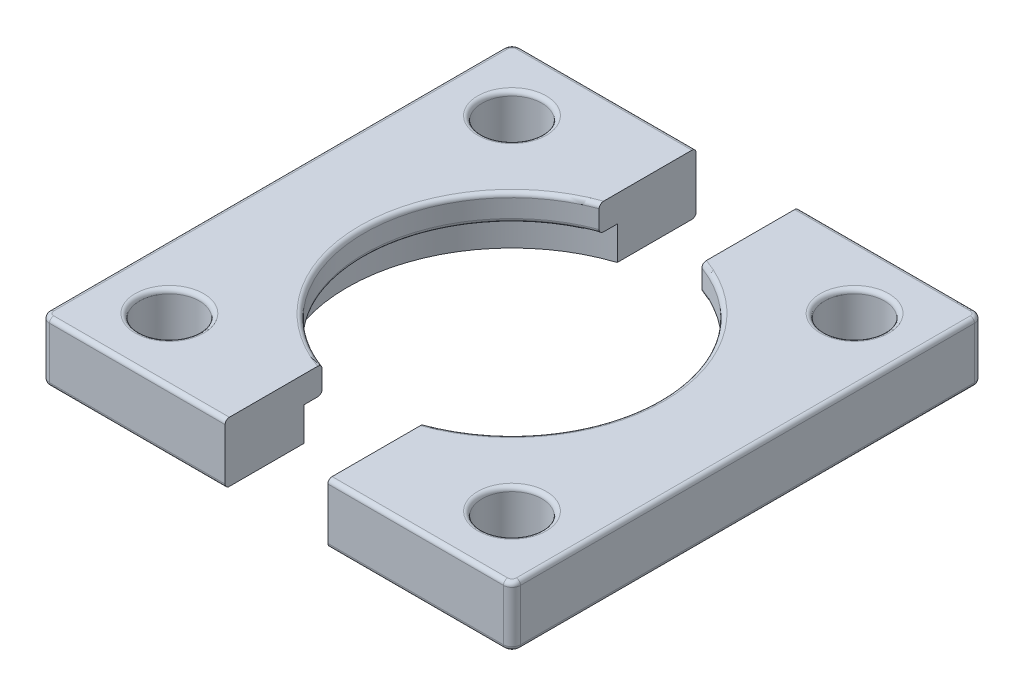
ISO-10303-21;
HEADER;
FILE_DESCRIPTION(('STEP AP214'),'2;1');
FILE_NAME('part.step','',(''),(''),'','','');
FILE_SCHEMA(('AUTOMOTIVE_DESIGN { 1 0 10303 214 1 1 1 1 }'));
ENDSEC;
DATA;
#1=APPLICATION_CONTEXT('core data for automotive mechanical design processes');
#2=APPLICATION_PROTOCOL_DEFINITION('international standard','automotive_design',2000,#1);
#3=PRODUCT_CONTEXT('',#1,'mechanical');
#4=PRODUCT('Part','Part','',(#3));
#5=PRODUCT_RELATED_PRODUCT_CATEGORY('part','',(#4));
#6=PRODUCT_DEFINITION_FORMATION('','',#4);
#7=PRODUCT_DEFINITION_CONTEXT('part definition',#1,'design');
#8=PRODUCT_DEFINITION('design','',#6,#7);
#9=PRODUCT_DEFINITION_SHAPE('','',#8);
#10=(LENGTH_UNIT() NAMED_UNIT(*) SI_UNIT(.MILLI.,.METRE.));
#11=(NAMED_UNIT(*) PLANE_ANGLE_UNIT() SI_UNIT($,.RADIAN.));
#12=(NAMED_UNIT(*) SI_UNIT($,.STERADIAN.) SOLID_ANGLE_UNIT());
#13=UNCERTAINTY_MEASURE_WITH_UNIT(LENGTH_MEASURE(1.E-05),#10,'distance_accuracy_value','');
#14=(GEOMETRIC_REPRESENTATION_CONTEXT(3) GLOBAL_UNCERTAINTY_ASSIGNED_CONTEXT((#13)) GLOBAL_UNIT_ASSIGNED_CONTEXT((#10,
#11,#12)) REPRESENTATION_CONTEXT('',''));
#15=CARTESIAN_POINT('',(0.,0.,0.));
#16=DIRECTION('',(0.,0.,1.));
#17=DIRECTION('',(1.,0.,0.));
#18=AXIS2_PLACEMENT_3D('',#15,#16,#17);
#19=CARTESIAN_POINT('',(0.,7.,0.));
#20=DIRECTION('',(0.,-1.,0.));
#21=DIRECTION('',(0.,0.,-1.));
#22=AXIS2_PLACEMENT_3D('',#19,#20,#21);
#23=CYLINDRICAL_SURFACE('',#22,17.25);
#24=DIRECTION('',(0.,-1.,0.));
#25=VECTOR('',#24,1.);
#26=CARTESIAN_POINT('',(6.,7.,-16.1728939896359));
#27=LINE('',#26,#25);
#28=CARTESIAN_POINT('',(6.,6.5,-16.1728939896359));
#29=VERTEX_POINT('',#28);
#30=CARTESIAN_POINT('',(6.,4.4,-16.1728939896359));
#31=VERTEX_POINT('',#30);
#32=EDGE_CURVE('E226',#29,#31,#27,.T.);
#33=ORIENTED_EDGE('',*,*,#32,.T.);
#34=CARTESIAN_POINT('',(0.,4.4,0.));
#35=DIRECTION('',(0.,-1.,0.));
#36=DIRECTION('',(0.,0.,-1.));
#37=AXIS2_PLACEMENT_3D('',#34,#35,#36);
#38=CIRCLE('',#37,17.25);
#39=CARTESIAN_POINT('',(6.,4.4,16.1728939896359));
#40=VERTEX_POINT('',#39);
#41=EDGE_CURVE('E412',#31,#40,#38,.T.);
#42=ORIENTED_EDGE('',*,*,#41,.T.);
#43=DIRECTION('',(0.,-1.,0.));
#44=VECTOR('',#43,1.);
#45=CARTESIAN_POINT('',(6.,7.,16.1728939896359));
#46=LINE('',#45,#44);
#47=CARTESIAN_POINT('',(6.,6.5,16.1728939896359));
#48=VERTEX_POINT('',#47);
#49=EDGE_CURVE('E223',#48,#40,#46,.T.);
#50=ORIENTED_EDGE('',*,*,#49,.F.);
#51=CARTESIAN_POINT('',(0.,6.5,0.));
#52=DIRECTION('',(0.,1.,0.));
#53=DIRECTION('',(0.,0.,1.));
#54=AXIS2_PLACEMENT_3D('',#51,#52,#53);
#55=CIRCLE('',#54,17.25);
#56=EDGE_CURVE('E414',#48,#29,#55,.T.);
#57=ORIENTED_EDGE('',*,*,#56,.T.);
#58=EDGE_LOOP('',(#33,#42,#50,#57));
#59=FACE_BOUND('',#58,.T.);
#60=ADVANCED_FACE('F43',(#59),#23,.F.);
#61=CARTESIAN_POINT('',(26.5,7.,26.5));
#62=DIRECTION('',(0.,1.,0.));
#63=DIRECTION('',(0.,0.,1.));
#64=AXIS2_PLACEMENT_3D('',#61,#62,#63);
#65=PLANE('',#64);
#66=CARTESIAN_POINT('',(20.,7.,20.));
#67=DIRECTION('',(0.,1.,0.));
#68=DIRECTION('',(0.,0.,1.));
#69=AXIS2_PLACEMENT_3D('',#66,#67,#68);
#70=CIRCLE('',#69,4.);
#71=CARTESIAN_POINT('',(20.,7.,24.));
#72=VERTEX_POINT('',#71);
#73=EDGE_CURVE('E433',#72,#72,#70,.F.);
#74=ORIENTED_EDGE('',*,*,#73,.T.);
#75=EDGE_LOOP('',(#74));
#76=FACE_BOUND('',#75,.T.);
#77=CARTESIAN_POINT('',(20.,7.,-20.));
#78=DIRECTION('',(0.,1.,0.));
#79=DIRECTION('',(0.,0.,1.));
#80=AXIS2_PLACEMENT_3D('',#77,#78,#79);
#81=CIRCLE('',#80,4.);
#82=CARTESIAN_POINT('',(20.,7.,-16.));
#83=VERTEX_POINT('',#82);
#84=EDGE_CURVE('E381',#83,#83,#81,.F.);
#85=ORIENTED_EDGE('',*,*,#84,.T.);
#86=EDGE_LOOP('',(#85));
#87=FACE_BOUND('',#86,.T.);
#88=CARTESIAN_POINT('',(26.5,7.,-26.5));
#89=DIRECTION('',(0.,1.,0.));
#90=DIRECTION('',(0.,0.,1.));
#91=AXIS2_PLACEMENT_3D('',#88,#89,#90);
#92=CIRCLE('',#91,0.500000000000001);
#93=CARTESIAN_POINT('',(27.,7.,-26.5));
#94=VERTEX_POINT('',#93);
#95=CARTESIAN_POINT('',(26.5,7.,-27.));
#96=VERTEX_POINT('',#95);
#97=EDGE_CURVE('E60',#94,#96,#92,.T.);
#98=ORIENTED_EDGE('',*,*,#97,.T.);
#99=DIRECTION('',(-1.,0.,0.));
#100=VECTOR('',#99,1.);
#101=CARTESIAN_POINT('',(6.,7.,-27.));
#102=LINE('',#101,#100);
#103=CARTESIAN_POINT('',(6.,7.,-27.));
#104=VERTEX_POINT('',#103);
#105=EDGE_CURVE('E422',#96,#104,#102,.T.);
#106=ORIENTED_EDGE('',*,*,#105,.T.);
#107=DIRECTION('',(0.,0.,1.));
#108=VECTOR('',#107,1.);
#109=CARTESIAN_POINT('',(6.,7.,-16.1728939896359));
#110=LINE('',#109,#108);
#111=CARTESIAN_POINT('',(6.,7.,-16.7051638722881));
#112=VERTEX_POINT('',#111);
#113=EDGE_CURVE('E210',#104,#112,#110,.T.);
#114=ORIENTED_EDGE('',*,*,#113,.T.);
#115=CARTESIAN_POINT('',(0.,7.,0.));
#116=DIRECTION('',(0.,1.,0.));
#117=DIRECTION('',(0.,0.,1.));
#118=AXIS2_PLACEMENT_3D('',#115,#116,#117);
#119=CIRCLE('',#118,17.75);
#120=CARTESIAN_POINT('',(6.,7.,16.7051638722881));
#121=VERTEX_POINT('',#120);
#122=EDGE_CURVE('E430',#112,#121,#119,.F.);
#123=ORIENTED_EDGE('',*,*,#122,.T.);
#124=DIRECTION('',(0.,0.,1.));
#125=VECTOR('',#124,1.);
#126=CARTESIAN_POINT('',(6.,7.,27.5));
#127=LINE('',#126,#125);
#128=CARTESIAN_POINT('',(6.,7.,27.));
#129=VERTEX_POINT('',#128);
#130=EDGE_CURVE('E213',#121,#129,#127,.T.);
#131=ORIENTED_EDGE('',*,*,#130,.T.);
#132=DIRECTION('',(1.,0.,0.));
#133=VECTOR('',#132,1.);
#134=CARTESIAN_POINT('',(26.5,7.,27.));
#135=LINE('',#134,#133);
#136=CARTESIAN_POINT('',(26.5,7.,27.));
#137=VERTEX_POINT('',#136);
#138=EDGE_CURVE('E428',#129,#137,#135,.T.);
#139=ORIENTED_EDGE('',*,*,#138,.T.);
#140=CARTESIAN_POINT('',(26.5,7.,26.5));
#141=DIRECTION('',(0.,1.,0.));
#142=DIRECTION('',(0.,0.,1.));
#143=AXIS2_PLACEMENT_3D('',#140,#141,#142);
#144=CIRCLE('',#143,0.500000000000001);
#145=CARTESIAN_POINT('',(27.,7.,26.5));
#146=VERTEX_POINT('',#145);
#147=EDGE_CURVE('E426',#137,#146,#144,.T.);
#148=ORIENTED_EDGE('',*,*,#147,.T.);
#149=DIRECTION('',(0.,0.,-1.));
#150=VECTOR('',#149,1.);
#151=CARTESIAN_POINT('',(27.,7.,-26.5));
#152=LINE('',#151,#150);
#153=EDGE_CURVE('E65',#146,#94,#152,.T.);
#154=ORIENTED_EDGE('',*,*,#153,.T.);
#155=EDGE_LOOP('',(#98,#106,#114,#123,#131,#139,#148,#154));
#156=FACE_BOUND('',#155,.T.);
#157=ADVANCED_FACE('F286',(#76,#87,#156),#65,.T.);
#158=CARTESIAN_POINT('',(26.5,0.,26.5));
#159=DIRECTION('',(0.,1.,0.));
#160=DIRECTION('',(0.,0.,1.));
#161=AXIS2_PLACEMENT_3D('',#158,#159,#160);
#162=PLANE('',#161);
#163=CARTESIAN_POINT('',(20.,0.,-20.));
#164=DIRECTION('',(0.,1.,0.));
#165=DIRECTION('',(0.,0.,-1.));
#166=AXIS2_PLACEMENT_3D('',#163,#164,#165);
#167=CIRCLE('',#166,3.5);
#168=CARTESIAN_POINT('',(20.,0.,-23.5));
#169=VERTEX_POINT('',#168);
#170=EDGE_CURVE('E182',#169,#169,#167,.T.);
#171=ORIENTED_EDGE('',*,*,#170,.T.);
#172=EDGE_LOOP('',(#171));
#173=FACE_BOUND('',#172,.T.);
#174=CARTESIAN_POINT('',(26.5,0.,26.5));
#175=DIRECTION('',(0.,1.,0.));
#176=DIRECTION('',(0.,0.,1.));
#177=AXIS2_PLACEMENT_3D('',#174,#175,#176);
#178=CIRCLE('',#177,0.500000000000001);
#179=CARTESIAN_POINT('',(27.,0.,26.5));
#180=VERTEX_POINT('',#179);
#181=CARTESIAN_POINT('',(26.5,0.,27.));
#182=VERTEX_POINT('',#181);
#183=EDGE_CURVE('E256',#180,#182,#178,.F.);
#184=ORIENTED_EDGE('',*,*,#183,.T.);
#185=DIRECTION('',(1.,0.,0.));
#186=VECTOR('',#185,1.);
#187=CARTESIAN_POINT('',(26.5,0.,27.));
#188=LINE('',#187,#186);
#189=CARTESIAN_POINT('',(6.,0.,27.));
#190=VERTEX_POINT('',#189);
#191=EDGE_CURVE('E258',#182,#190,#188,.F.);
#192=ORIENTED_EDGE('',*,*,#191,.T.);
#193=DIRECTION('',(0.,0.,1.));
#194=VECTOR('',#193,1.);
#195=CARTESIAN_POINT('',(6.,0.,27.5));
#196=LINE('',#195,#194);
#197=CARTESIAN_POINT('',(6.,0.,18.2910497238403));
#198=VERTEX_POINT('',#197);
#199=EDGE_CURVE('E181',#198,#190,#196,.T.);
#200=ORIENTED_EDGE('',*,*,#199,.F.);
#201=CARTESIAN_POINT('',(0.,0.,0.));
#202=DIRECTION('',(0.,-1.,0.));
#203=DIRECTION('',(0.,0.,-1.));
#204=AXIS2_PLACEMENT_3D('',#201,#202,#203);
#205=CIRCLE('',#204,19.25);
#206=CARTESIAN_POINT('',(6.,0.,-18.2910497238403));
#207=VERTEX_POINT('',#206);
#208=EDGE_CURVE('E188',#207,#198,#205,.T.);
#209=ORIENTED_EDGE('',*,*,#208,.F.);
#210=DIRECTION('',(0.,0.,1.));
#211=VECTOR('',#210,1.);
#212=CARTESIAN_POINT('',(6.,0.,-16.1728939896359));
#213=LINE('',#212,#211);
#214=CARTESIAN_POINT('',(6.,0.,-27.));
#215=VERTEX_POINT('',#214);
#216=EDGE_CURVE('E170',#215,#207,#213,.T.);
#217=ORIENTED_EDGE('',*,*,#216,.F.);
#218=DIRECTION('',(-1.,0.,0.));
#219=VECTOR('',#218,1.);
#220=CARTESIAN_POINT('',(26.5,0.,-27.));
#221=LINE('',#220,#219);
#222=CARTESIAN_POINT('',(26.5,0.,-27.));
#223=VERTEX_POINT('',#222);
#224=EDGE_CURVE('E254',#215,#223,#221,.F.);
#225=ORIENTED_EDGE('',*,*,#224,.T.);
#226=CARTESIAN_POINT('',(26.5,0.,-26.5));
#227=DIRECTION('',(0.,1.,0.));
#228=DIRECTION('',(0.,0.,1.));
#229=AXIS2_PLACEMENT_3D('',#226,#227,#228);
#230=CIRCLE('',#229,0.500000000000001);
#231=CARTESIAN_POINT('',(27.,0.,-26.5));
#232=VERTEX_POINT('',#231);
#233=EDGE_CURVE('E252',#223,#232,#230,.F.);
#234=ORIENTED_EDGE('',*,*,#233,.T.);
#235=DIRECTION('',(0.,0.,-1.));
#236=VECTOR('',#235,1.);
#237=CARTESIAN_POINT('',(27.,0.,26.5));
#238=LINE('',#237,#236);
#239=EDGE_CURVE('E250',#232,#180,#238,.F.);
#240=ORIENTED_EDGE('',*,*,#239,.T.);
#241=EDGE_LOOP('',(#184,#192,#200,#209,#217,#225,#234,#240));
#242=FACE_BOUND('',#241,.T.);
#243=CARTESIAN_POINT('',(20.,0.,20.));
#244=DIRECTION('',(0.,1.,0.));
#245=DIRECTION('',(0.,0.,1.));
#246=AXIS2_PLACEMENT_3D('',#243,#244,#245);
#247=CIRCLE('',#246,3.5);
#248=CARTESIAN_POINT('',(20.,0.,23.5));
#249=VERTEX_POINT('',#248);
#250=EDGE_CURVE('E191',#249,#249,#247,.T.);
#251=ORIENTED_EDGE('',*,*,#250,.T.);
#252=EDGE_LOOP('',(#251));
#253=FACE_BOUND('',#252,.T.);
#254=ADVANCED_FACE('F195',(#173,#242,#253),#162,.F.);
#255=CARTESIAN_POINT('',(26.5,7.,26.5));
#256=DIRECTION('',(0.,-1.,0.));
#257=DIRECTION('',(0.,0.,-1.));
#258=AXIS2_PLACEMENT_3D('',#255,#256,#257);
#259=CYLINDRICAL_SURFACE('',#258,1.);
#260=DIRECTION('',(0.,-1.,0.));
#261=VECTOR('',#260,1.);
#262=CARTESIAN_POINT('',(26.5,7.,27.5));
#263=LINE('',#262,#261);
#264=CARTESIAN_POINT('',(26.5,6.5,27.5));
#265=VERTEX_POINT('',#264);
#266=CARTESIAN_POINT('',(26.5,0.5,27.5));
#267=VERTEX_POINT('',#266);
#268=EDGE_CURVE('E215',#265,#267,#263,.T.);
#269=ORIENTED_EDGE('',*,*,#268,.T.);
#270=CARTESIAN_POINT('',(26.5,0.5,26.5));
#271=DIRECTION('',(0.,1.,0.));
#272=DIRECTION('',(0.,0.,1.));
#273=AXIS2_PLACEMENT_3D('',#270,#271,#272);
#274=CIRCLE('',#273,1.);
#275=CARTESIAN_POINT('',(27.5,0.5,26.5));
#276=VERTEX_POINT('',#275);
#277=EDGE_CURVE('E445',#267,#276,#274,.T.);
#278=ORIENTED_EDGE('',*,*,#277,.T.);
#279=DIRECTION('',(0.,-1.,0.));
#280=VECTOR('',#279,1.);
#281=CARTESIAN_POINT('',(27.5,7.,26.5));
#282=LINE('',#281,#280);
#283=CARTESIAN_POINT('',(27.5,6.5,26.5));
#284=VERTEX_POINT('',#283);
#285=EDGE_CURVE('E237',#284,#276,#282,.T.);
#286=ORIENTED_EDGE('',*,*,#285,.F.);
#287=CARTESIAN_POINT('',(26.5,6.5,26.5));
#288=DIRECTION('',(0.,1.,0.));
#289=DIRECTION('',(0.,0.,1.));
#290=AXIS2_PLACEMENT_3D('',#287,#288,#289);
#291=CIRCLE('',#290,1.);
#292=EDGE_CURVE('E447',#284,#265,#291,.F.);
#293=ORIENTED_EDGE('',*,*,#292,.T.);
#294=EDGE_LOOP('',(#269,#278,#286,#293));
#295=FACE_BOUND('',#294,.T.);
#296=ADVANCED_FACE('F355',(#295),#259,.T.);
#297=CARTESIAN_POINT('',(27.5,7.,-26.5));
#298=DIRECTION('',(-1.,0.,0.));
#299=DIRECTION('',(0.,0.,1.));
#300=AXIS2_PLACEMENT_3D('',#297,#298,#299);
#301=PLANE('',#300);
#302=DIRECTION('',(0.,-1.,0.));
#303=VECTOR('',#302,1.);
#304=CARTESIAN_POINT('',(27.5,7.,-26.5));
#305=LINE('',#304,#303);
#306=CARTESIAN_POINT('',(27.5,6.5,-26.5));
#307=VERTEX_POINT('',#306);
#308=CARTESIAN_POINT('',(27.5,0.5,-26.5));
#309=VERTEX_POINT('',#308);
#310=EDGE_CURVE('E234',#307,#309,#305,.T.);
#311=ORIENTED_EDGE('',*,*,#310,.F.);
#312=DIRECTION('',(0.,0.,-1.));
#313=VECTOR('',#312,1.);
#314=CARTESIAN_POINT('',(27.5,6.5,26.5));
#315=LINE('',#314,#313);
#316=EDGE_CURVE('E419',#307,#284,#315,.F.);
#317=ORIENTED_EDGE('',*,*,#316,.T.);
#318=ORIENTED_EDGE('',*,*,#285,.T.);
#319=DIRECTION('',(0.,0.,-1.));
#320=VECTOR('',#319,1.);
#321=CARTESIAN_POINT('',(27.5,0.5,-26.5));
#322=LINE('',#321,#320);
#323=EDGE_CURVE('E385',#276,#309,#322,.T.);
#324=ORIENTED_EDGE('',*,*,#323,.T.);
#325=EDGE_LOOP('',(#311,#317,#318,#324));
#326=FACE_BOUND('',#325,.T.);
#327=ADVANCED_FACE('F358',(#326),#301,.F.);
#328=CARTESIAN_POINT('',(26.5,7.,-26.5));
#329=DIRECTION('',(0.,-1.,0.));
#330=DIRECTION('',(0.,0.,-1.));
#331=AXIS2_PLACEMENT_3D('',#328,#329,#330);
#332=CYLINDRICAL_SURFACE('',#331,1.);
#333=ORIENTED_EDGE('',*,*,#310,.T.);
#334=CARTESIAN_POINT('',(26.5,0.5,-26.5));
#335=DIRECTION('',(0.,1.,0.));
#336=DIRECTION('',(0.,0.,1.));
#337=AXIS2_PLACEMENT_3D('',#334,#335,#336);
#338=CIRCLE('',#337,1.);
#339=CARTESIAN_POINT('',(26.5,0.5,-27.5));
#340=VERTEX_POINT('',#339);
#341=EDGE_CURVE('E372',#309,#340,#338,.T.);
#342=ORIENTED_EDGE('',*,*,#341,.T.);
#343=DIRECTION('',(0.,-1.,0.));
#344=VECTOR('',#343,1.);
#345=CARTESIAN_POINT('',(26.5,7.,-27.5));
#346=LINE('',#345,#344);
#347=CARTESIAN_POINT('',(26.5,6.5,-27.5));
#348=VERTEX_POINT('',#347);
#349=EDGE_CURVE('E231',#348,#340,#346,.T.);
#350=ORIENTED_EDGE('',*,*,#349,.F.);
#351=CARTESIAN_POINT('',(26.5,6.5,-26.5));
#352=DIRECTION('',(0.,1.,0.));
#353=DIRECTION('',(0.,0.,1.));
#354=AXIS2_PLACEMENT_3D('',#351,#352,#353);
#355=CIRCLE('',#354,1.);
#356=EDGE_CURVE('E374',#348,#307,#355,.F.);
#357=ORIENTED_EDGE('',*,*,#356,.T.);
#358=EDGE_LOOP('',(#333,#342,#350,#357));
#359=FACE_BOUND('',#358,.T.);
#360=ADVANCED_FACE('F361',(#359),#332,.T.);
#361=CARTESIAN_POINT('',(6.,7.,-27.5));
#362=DIRECTION('',(0.,0.,1.));
#363=DIRECTION('',(1.,0.,0.));
#364=AXIS2_PLACEMENT_3D('',#361,#362,#363);
#365=PLANE('',#364);
#366=ORIENTED_EDGE('',*,*,#349,.T.);
#367=DIRECTION('',(-1.,0.,0.));
#368=VECTOR('',#367,1.);
#369=CARTESIAN_POINT('',(6.,0.5,-27.5));
#370=LINE('',#369,#368);
#371=CARTESIAN_POINT('',(6.,0.5,-27.5));
#372=VERTEX_POINT('',#371);
#373=EDGE_CURVE('E444',#340,#372,#370,.T.);
#374=ORIENTED_EDGE('',*,*,#373,.T.);
#375=DIRECTION('',(0.,-1.,0.));
#376=VECTOR('',#375,1.);
#377=CARTESIAN_POINT('',(6.,7.,-27.5));
#378=LINE('',#377,#376);
#379=CARTESIAN_POINT('',(6.,6.5,-27.5));
#380=VERTEX_POINT('',#379);
#381=EDGE_CURVE('E229',#380,#372,#378,.T.);
#382=ORIENTED_EDGE('',*,*,#381,.F.);
#383=DIRECTION('',(-1.,0.,0.));
#384=VECTOR('',#383,1.);
#385=CARTESIAN_POINT('',(26.5,6.5,-27.5));
#386=LINE('',#385,#384);
#387=EDGE_CURVE('E442',#380,#348,#386,.F.);
#388=ORIENTED_EDGE('',*,*,#387,.T.);
#389=EDGE_LOOP('',(#366,#374,#382,#388));
#390=FACE_BOUND('',#389,.T.);
#391=ADVANCED_FACE('F291',(#390),#365,.F.);
#392=CARTESIAN_POINT('',(6.,7.,-16.1728939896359));
#393=DIRECTION('',(1.,0.,0.));
#394=DIRECTION('',(0.,0.,-1.));
#395=AXIS2_PLACEMENT_3D('',#392,#393,#394);
#396=PLANE('',#395);
#397=ORIENTED_EDGE('',*,*,#381,.T.);
#398=CARTESIAN_POINT('',(6.,0.5,-27.));
#399=DIRECTION('',(1.,0.,0.));
#400=DIRECTION('',(0.,0.,-1.));
#401=AXIS2_PLACEMENT_3D('',#398,#399,#400);
#402=CIRCLE('',#401,0.5);
#403=EDGE_CURVE('E177',#372,#215,#402,.F.);
#404=ORIENTED_EDGE('',*,*,#403,.T.);
#405=ORIENTED_EDGE('',*,*,#216,.T.);
#406=DIRECTION('',(0.,-1.,0.));
#407=VECTOR('',#406,1.);
#408=CARTESIAN_POINT('',(6.,3.9,-18.2910497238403));
#409=LINE('',#408,#407);
#410=CARTESIAN_POINT('',(6.,3.9,-18.2910497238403));
#411=VERTEX_POINT('',#410);
#412=EDGE_CURVE('E175',#207,#411,#409,.F.);
#413=ORIENTED_EDGE('',*,*,#412,.T.);
#414=DIRECTION('',(0.,0.,-1.));
#415=VECTOR('',#414,1.);
#416=CARTESIAN_POINT('',(6.,3.9,-16.1728939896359));
#417=LINE('',#416,#415);
#418=CARTESIAN_POINT('',(6.,3.9,-16.7051638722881));
#419=VERTEX_POINT('',#418);
#420=EDGE_CURVE('E192',#419,#411,#417,.T.);
#421=ORIENTED_EDGE('',*,*,#420,.F.);
#422=CARTESIAN_POINT('',(6.,3.9,-16.7051638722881));
#423=CARTESIAN_POINT('',(6.,3.89998324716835,-16.6737836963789));
#424=CARTESIAN_POINT('',(6.,3.90261597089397,-16.6424011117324));
#425=CARTESIAN_POINT('',(6.,3.91305838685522,-16.5804751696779));
#426=CARTESIAN_POINT('',(6.,3.9208736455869,-16.5499327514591));
#427=CARTESIAN_POINT('',(6.,3.94156927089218,-16.4905719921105));
#428=CARTESIAN_POINT('',(6.,3.95445483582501,-16.4617554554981));
#429=CARTESIAN_POINT('',(6.,3.9850167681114,-16.4067996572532));
#430=CARTESIAN_POINT('',(6.,4.00268991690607,-16.3806586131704));
#431=CARTESIAN_POINT('',(6.,4.04183083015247,-16.3326713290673));
#432=CARTESIAN_POINT('',(6.,4.06316995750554,-16.3107203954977));
#433=CARTESIAN_POINT('',(6.,4.10944916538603,-16.270989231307));
#434=CARTESIAN_POINT('',(6.,4.13438917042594,-16.2532089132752));
#435=CARTESIAN_POINT('',(6.,4.18552925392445,-16.2234981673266));
#436=CARTESIAN_POINT('',(6.,4.2115618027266,-16.2112788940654));
#437=CARTESIAN_POINT('',(6.,4.26537512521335,-16.1916967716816));
#438=CARTESIAN_POINT('',(6.,4.29315309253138,-16.1843263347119));
#439=CARTESIAN_POINT('',(6.,4.3343363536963,-16.1773253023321));
#440=CARTESIAN_POINT('',(6.,4.3474235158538,-16.1756641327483));
#441=CARTESIAN_POINT('',(6.,4.37367143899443,-16.1734493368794));
#442=CARTESIAN_POINT('',(6.,4.38683206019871,-16.1728940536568));
#443=CARTESIAN_POINT('',(6.,4.39999999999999,-16.1728939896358));
#444=B_SPLINE_CURVE_WITH_KNOTS('',3,(#422,#423,#424,#425,#426,#427,#428,#429,#430,#431,#432,
#433,#434,#435,#436,#437,#438,#439,#440,#441,#442,#443),.UNSPECIFIED.,.F.,.F.,(4,2,2,2,2,2,2,2,
2,2,4),(0.,0.0940360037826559,0.188173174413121,0.282407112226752,0.376577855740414,
0.467944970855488,0.559310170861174,0.645147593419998,0.730850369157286,0.770387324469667,
0.809864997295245),.UNSPECIFIED.);
#445=EDGE_CURVE('E301',#419,#31,#444,.T.);
#446=ORIENTED_EDGE('',*,*,#445,.T.);
#447=ORIENTED_EDGE('',*,*,#32,.F.);
#448=CARTESIAN_POINT('',(6.,6.5,-16.1728939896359));
#449=CARTESIAN_POINT('',(6.,6.52687708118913,-16.1728628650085));
#450=CARTESIAN_POINT('',(6.,6.55373648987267,-16.1752033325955));
#451=CARTESIAN_POINT('',(6.,6.606607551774,-16.1843847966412));
#452=CARTESIAN_POINT('',(6.,6.63262117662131,-16.1912143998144));
#453=CARTESIAN_POINT('',(6.,6.68312790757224,-16.2091323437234));
#454=CARTESIAN_POINT('',(6.,6.70762124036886,-16.2202200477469));
#455=CARTESIAN_POINT('',(6.,6.75447049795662,-16.2462455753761));
#456=CARTESIAN_POINT('',(6.,6.77682572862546,-16.2611846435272));
#457=CARTESIAN_POINT('',(6.,6.8194336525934,-16.2948629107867));
#458=CARTESIAN_POINT('',(6.,6.83961483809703,-16.313692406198));
#459=CARTESIAN_POINT('',(6.,6.87674555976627,-16.3543036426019));
#460=CARTESIAN_POINT('',(6.,6.89369424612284,-16.3760861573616));
#461=CARTESIAN_POINT('',(6.,6.92493767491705,-16.4233510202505));
#462=CARTESIAN_POINT('',(6.,6.93901668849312,-16.4489758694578));
#463=CARTESIAN_POINT('',(6.,6.96293340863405,-16.5021368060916));
#464=CARTESIAN_POINT('',(6.,6.97277019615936,-16.5296733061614));
#465=CARTESIAN_POINT('',(6.,6.98691227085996,-16.581802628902));
#466=CARTESIAN_POINT('',(6.,6.99181703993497,-16.6062352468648));
#467=CARTESIAN_POINT('',(6.,6.99836115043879,-16.6554988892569));
#468=CARTESIAN_POINT('',(6.,7.00000510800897,-16.6803293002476));
#469=CARTESIAN_POINT('',(6.,7.,-16.7051638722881));
#470=B_SPLINE_CURVE_WITH_KNOTS('',3,(#448,#449,#450,#451,#452,#453,#454,#455,#456,#457,#458,
#459,#460,#461,#462,#463,#464,#465,#466,#467,#468,#469),.UNSPECIFIED.,.F.,.F.,(4,2,2,2,2,2,2,2,
2,2,4),(0.,0.0805022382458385,0.160800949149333,0.24108765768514,0.321400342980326,
0.403843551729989,0.486308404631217,0.573641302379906,0.660993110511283,0.735540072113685,
0.80998142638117),.UNSPECIFIED.);
#471=EDGE_CURVE('E295',#29,#112,#470,.T.);
#472=ORIENTED_EDGE('',*,*,#471,.T.);
#473=ORIENTED_EDGE('',*,*,#113,.F.);
#474=CARTESIAN_POINT('',(6.,6.5,-27.));
#475=DIRECTION('',(1.,0.,0.));
#476=DIRECTION('',(0.,0.,-1.));
#477=AXIS2_PLACEMENT_3D('',#474,#475,#476);
#478=CIRCLE('',#477,0.5);
#479=EDGE_CURVE('E306',#104,#380,#478,.F.);
#480=ORIENTED_EDGE('',*,*,#479,.T.);
#481=EDGE_LOOP('',(#397,#404,#405,#413,#421,#446,#447,#472,#473,#480));
#482=FACE_BOUND('',#481,.T.);
#483=ADVANCED_FACE('F173',(#482),#396,.F.);
#484=CARTESIAN_POINT('',(6.,7.,27.5));
#485=DIRECTION('',(1.,0.,0.));
#486=DIRECTION('',(0.,0.,-1.));
#487=AXIS2_PLACEMENT_3D('',#484,#485,#486);
#488=PLANE('',#487);
#489=ORIENTED_EDGE('',*,*,#199,.T.);
#490=CARTESIAN_POINT('',(6.,0.5,27.));
#491=DIRECTION('',(1.,0.,0.));
#492=DIRECTION('',(0.,0.,-1.));
#493=AXIS2_PLACEMENT_3D('',#490,#491,#492);
#494=CIRCLE('',#493,0.5);
#495=CARTESIAN_POINT('',(6.,0.5,27.5));
#496=VERTEX_POINT('',#495);
#497=EDGE_CURVE('E451',#190,#496,#494,.F.);
#498=ORIENTED_EDGE('',*,*,#497,.T.);
#499=DIRECTION('',(0.,-1.,0.));
#500=VECTOR('',#499,1.);
#501=CARTESIAN_POINT('',(6.,7.,27.5));
#502=LINE('',#501,#500);
#503=CARTESIAN_POINT('',(6.,6.5,27.5));
#504=VERTEX_POINT('',#503);
#505=EDGE_CURVE('E220',#504,#496,#502,.T.);
#506=ORIENTED_EDGE('',*,*,#505,.F.);
#507=CARTESIAN_POINT('',(6.,6.5,27.));
#508=DIRECTION('',(1.,0.,0.));
#509=DIRECTION('',(0.,0.,-1.));
#510=AXIS2_PLACEMENT_3D('',#507,#508,#509);
#511=CIRCLE('',#510,0.5);
#512=EDGE_CURVE('E452',#504,#129,#511,.F.);
#513=ORIENTED_EDGE('',*,*,#512,.T.);
#514=ORIENTED_EDGE('',*,*,#130,.F.);
#515=CARTESIAN_POINT('',(6.,7.,16.7051638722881));
#516=CARTESIAN_POINT('',(6.,7.00001675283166,16.6737836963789));
#517=CARTESIAN_POINT('',(6.,6.99738402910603,16.6424011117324));
#518=CARTESIAN_POINT('',(6.,6.98694161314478,16.5804751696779));
#519=CARTESIAN_POINT('',(6.,6.9791263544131,16.5499327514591));
#520=CARTESIAN_POINT('',(6.,6.95843072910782,16.4905719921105));
#521=CARTESIAN_POINT('',(6.,6.94554516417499,16.4617554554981));
#522=CARTESIAN_POINT('',(6.,6.9149832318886,16.4067996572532));
#523=CARTESIAN_POINT('',(6.,6.89731008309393,16.3806586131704));
#524=CARTESIAN_POINT('',(6.,6.85816916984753,16.3326713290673));
#525=CARTESIAN_POINT('',(6.,6.83683004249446,16.3107203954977));
#526=CARTESIAN_POINT('',(6.,6.79055083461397,16.270989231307));
#527=CARTESIAN_POINT('',(6.,6.76561082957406,16.2532089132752));
#528=CARTESIAN_POINT('',(6.,6.71447074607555,16.2234981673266));
#529=CARTESIAN_POINT('',(6.,6.6884381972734,16.2112788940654));
#530=CARTESIAN_POINT('',(6.,6.63462487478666,16.1916967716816));
#531=CARTESIAN_POINT('',(6.,6.60684690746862,16.1843263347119));
#532=CARTESIAN_POINT('',(6.,6.5656636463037,16.1773253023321));
#533=CARTESIAN_POINT('',(6.,6.5525764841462,16.1756641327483));
#534=CARTESIAN_POINT('',(6.,6.52632856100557,16.1734493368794));
#535=CARTESIAN_POINT('',(6.,6.51316793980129,16.1728940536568));
#536=CARTESIAN_POINT('',(6.,6.50000000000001,16.1728939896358));
#537=B_SPLINE_CURVE_WITH_KNOTS('',3,(#515,#516,#517,#518,#519,#520,#521,#522,#523,#524,#525,
#526,#527,#528,#529,#530,#531,#532,#533,#534,#535,#536),.UNSPECIFIED.,.F.,.F.,(4,2,2,2,2,2,2,2,
2,2,4),(0.,0.0940360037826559,0.188173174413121,0.282407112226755,0.376577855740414,
0.467944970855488,0.559310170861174,0.645147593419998,0.730850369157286,0.770387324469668,
0.809864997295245),.UNSPECIFIED.);
#538=EDGE_CURVE('E260',#121,#48,#537,.T.);
#539=ORIENTED_EDGE('',*,*,#538,.T.);
#540=ORIENTED_EDGE('',*,*,#49,.T.);
#541=CARTESIAN_POINT('',(6.,4.4,16.1728939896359));
#542=CARTESIAN_POINT('',(6.,4.37312291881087,16.1728628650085));
#543=CARTESIAN_POINT('',(6.,4.34626351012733,16.1752033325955));
#544=CARTESIAN_POINT('',(6.,4.293392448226,16.1843847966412));
#545=CARTESIAN_POINT('',(6.,4.26737882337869,16.1912143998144));
#546=CARTESIAN_POINT('',(6.,4.21687209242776,16.2091323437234));
#547=CARTESIAN_POINT('',(6.,4.19237875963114,16.2202200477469));
#548=CARTESIAN_POINT('',(6.,4.14552950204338,16.2462455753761));
#549=CARTESIAN_POINT('',(6.,4.12317427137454,16.2611846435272));
#550=CARTESIAN_POINT('',(6.,4.0805663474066,16.2948629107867));
#551=CARTESIAN_POINT('',(6.,4.06038516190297,16.313692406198));
#552=CARTESIAN_POINT('',(6.,4.02325444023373,16.3543036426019));
#553=CARTESIAN_POINT('',(6.,4.00630575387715,16.3760861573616));
#554=CARTESIAN_POINT('',(6.,3.97506232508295,16.4233510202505));
#555=CARTESIAN_POINT('',(6.,3.96098331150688,16.4489758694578));
#556=CARTESIAN_POINT('',(6.,3.93706659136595,16.5021368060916));
#557=CARTESIAN_POINT('',(6.,3.92722980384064,16.5296733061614));
#558=CARTESIAN_POINT('',(6.,3.91308772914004,16.581802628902));
#559=CARTESIAN_POINT('',(6.,3.90818296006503,16.6062352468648));
#560=CARTESIAN_POINT('',(6.,3.90163884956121,16.6554988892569));
#561=CARTESIAN_POINT('',(6.,3.89999489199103,16.6803293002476));
#562=CARTESIAN_POINT('',(6.,3.9,16.7051638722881));
#563=B_SPLINE_CURVE_WITH_KNOTS('',3,(#541,#542,#543,#544,#545,#546,#547,#548,#549,#550,#551,
#552,#553,#554,#555,#556,#557,#558,#559,#560,#561,#562),.UNSPECIFIED.,.F.,.F.,(4,2,2,2,2,2,2,2,
2,2,4),(0.,0.0805022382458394,0.160800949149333,0.24108765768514,0.321400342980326,
0.403843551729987,0.486308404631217,0.573641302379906,0.660993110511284,0.735540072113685,
0.809981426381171),.UNSPECIFIED.);
#564=CARTESIAN_POINT('',(6.,3.9,16.7051638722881));
#565=VERTEX_POINT('',#564);
#566=EDGE_CURVE('E267',#40,#565,#563,.T.);
#567=ORIENTED_EDGE('',*,*,#566,.T.);
#568=DIRECTION('',(0.,0.,-1.));
#569=VECTOR('',#568,1.);
#570=CARTESIAN_POINT('',(6.,3.9,27.5));
#571=LINE('',#570,#569);
#572=CARTESIAN_POINT('',(6.,3.9,18.2910497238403));
#573=VERTEX_POINT('',#572);
#574=EDGE_CURVE('E240',#573,#565,#571,.T.);
#575=ORIENTED_EDGE('',*,*,#574,.F.);
#576=DIRECTION('',(0.,-1.,0.));
#577=VECTOR('',#576,1.);
#578=CARTESIAN_POINT('',(6.,3.9,18.2910497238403));
#579=LINE('',#578,#577);
#580=EDGE_CURVE('E243',#573,#198,#579,.T.);
#581=ORIENTED_EDGE('',*,*,#580,.T.);
#582=EDGE_LOOP('',(#489,#498,#506,#513,#514,#539,#540,#567,#575,#581));
#583=FACE_BOUND('',#582,.T.);
#584=ADVANCED_FACE('F275',(#583),#488,.F.);
#585=CARTESIAN_POINT('',(6.,7.,27.5));
#586=DIRECTION('',(0.,0.,-1.));
#587=DIRECTION('',(-1.,0.,0.));
#588=AXIS2_PLACEMENT_3D('',#585,#586,#587);
#589=PLANE('',#588);
#590=ORIENTED_EDGE('',*,*,#505,.T.);
#591=DIRECTION('',(1.,0.,0.));
#592=VECTOR('',#591,1.);
#593=CARTESIAN_POINT('',(6.,0.5,27.5));
#594=LINE('',#593,#592);
#595=EDGE_CURVE('E247',#496,#267,#594,.T.);
#596=ORIENTED_EDGE('',*,*,#595,.T.);
#597=ORIENTED_EDGE('',*,*,#268,.F.);
#598=DIRECTION('',(1.,0.,0.));
#599=VECTOR('',#598,1.);
#600=CARTESIAN_POINT('',(6.,6.5,27.5));
#601=LINE('',#600,#599);
#602=EDGE_CURVE('E245',#265,#504,#601,.F.);
#603=ORIENTED_EDGE('',*,*,#602,.T.);
#604=EDGE_LOOP('',(#590,#596,#597,#603));
#605=FACE_BOUND('',#604,.T.);
#606=ADVANCED_FACE('F280',(#605),#589,.F.);
#607=CARTESIAN_POINT('',(20.,7.,-20.));
#608=DIRECTION('',(0.,-1.,0.));
#609=DIRECTION('',(0.,0.,-1.));
#610=AXIS2_PLACEMENT_3D('',#607,#608,#609);
#611=CYLINDRICAL_SURFACE('',#610,3.5);
#612=CARTESIAN_POINT('',(20.,6.5,-20.));
#613=DIRECTION('',(0.,1.,0.));
#614=DIRECTION('',(0.,0.,1.));
#615=AXIS2_PLACEMENT_3D('',#612,#613,#614);
#616=CIRCLE('',#615,3.5);
#617=CARTESIAN_POINT('',(20.,6.5,-16.5));
#618=VERTEX_POINT('',#617);
#619=EDGE_CURVE('E12',#618,#618,#616,.T.);
#620=ORIENTED_EDGE('',*,*,#619,.T.);
#621=EDGE_LOOP('',(#620));
#622=FACE_BOUND('',#621,.T.);
#623=ORIENTED_EDGE('',*,*,#170,.F.);
#624=EDGE_LOOP('',(#623));
#625=FACE_BOUND('',#624,.T.);
#626=ADVANCED_FACE('F475',(#622,#625),#611,.F.);
#627=CARTESIAN_POINT('',(20.,7.,20.));
#628=DIRECTION('',(0.,-1.,0.));
#629=DIRECTION('',(0.,0.,-1.));
#630=AXIS2_PLACEMENT_3D('',#627,#628,#629);
#631=CYLINDRICAL_SURFACE('',#630,3.5);
#632=CARTESIAN_POINT('',(20.,6.5,20.));
#633=DIRECTION('',(0.,1.,0.));
#634=DIRECTION('',(0.,0.,1.));
#635=AXIS2_PLACEMENT_3D('',#632,#633,#634);
#636=CIRCLE('',#635,3.5);
#637=CARTESIAN_POINT('',(20.,6.5,23.5));
#638=VERTEX_POINT('',#637);
#639=EDGE_CURVE('E52',#638,#638,#636,.T.);
#640=ORIENTED_EDGE('',*,*,#639,.T.);
#641=EDGE_LOOP('',(#640));
#642=FACE_BOUND('',#641,.T.);
#643=ORIENTED_EDGE('',*,*,#250,.F.);
#644=EDGE_LOOP('',(#643));
#645=FACE_BOUND('',#644,.T.);
#646=ADVANCED_FACE('F479',(#642,#645),#631,.F.);
#647=CARTESIAN_POINT('',(0.,3.9,0.));
#648=DIRECTION('',(0.,-1.,0.));
#649=DIRECTION('',(0.,0.,-1.));
#650=AXIS2_PLACEMENT_3D('',#647,#648,#649);
#651=CYLINDRICAL_SURFACE('',#650,19.25);
#652=ORIENTED_EDGE('',*,*,#208,.T.);
#653=ORIENTED_EDGE('',*,*,#580,.F.);
#654=CARTESIAN_POINT('',(0.,3.9,0.));
#655=DIRECTION('',(0.,-1.,0.));
#656=DIRECTION('',(0.,0.,-1.));
#657=AXIS2_PLACEMENT_3D('',#654,#655,#656);
#658=CIRCLE('',#657,19.25);
#659=EDGE_CURVE('E190',#411,#573,#658,.T.);
#660=ORIENTED_EDGE('',*,*,#659,.F.);
#661=ORIENTED_EDGE('',*,*,#412,.F.);
#662=EDGE_LOOP('',(#652,#653,#660,#661));
#663=FACE_BOUND('',#662,.T.);
#664=ADVANCED_FACE('F186',(#663),#651,.F.);
#665=CARTESIAN_POINT('',(0.,3.9,0.));
#666=DIRECTION('',(0.,-1.,0.));
#667=DIRECTION('',(0.,0.,-1.));
#668=AXIS2_PLACEMENT_3D('',#665,#666,#667);
#669=PLANE('',#668);
#670=ORIENTED_EDGE('',*,*,#574,.T.);
#671=CARTESIAN_POINT('',(0.,3.9,0.));
#672=DIRECTION('',(0.,-1.,0.));
#673=DIRECTION('',(0.,0.,-1.));
#674=AXIS2_PLACEMENT_3D('',#671,#672,#673);
#675=CIRCLE('',#674,17.75);
#676=EDGE_CURVE('E416',#565,#419,#675,.F.);
#677=ORIENTED_EDGE('',*,*,#676,.T.);
#678=ORIENTED_EDGE('',*,*,#420,.T.);
#679=ORIENTED_EDGE('',*,*,#659,.T.);
#680=EDGE_LOOP('',(#670,#677,#678,#679));
#681=FACE_BOUND('',#680,.T.);
#682=ADVANCED_FACE('F339',(#681),#669,.T.);
#683=CARTESIAN_POINT('',(6.,0.5,-27.));
#684=DIRECTION('',(-1.,0.,0.));
#685=DIRECTION('',(0.,0.,1.));
#686=AXIS2_PLACEMENT_3D('',#683,#684,#685);
#687=CYLINDRICAL_SURFACE('',#686,0.5);
#688=ORIENTED_EDGE('',*,*,#403,.F.);
#689=ORIENTED_EDGE('',*,*,#373,.F.);
#690=CARTESIAN_POINT('',(26.5,0.5,-27.));
#691=DIRECTION('',(1.,0.,0.));
#692=DIRECTION('',(0.,0.,-1.));
#693=AXIS2_PLACEMENT_3D('',#690,#691,#692);
#694=CIRCLE('',#693,0.5);
#695=EDGE_CURVE('E198',#223,#340,#694,.T.);
#696=ORIENTED_EDGE('',*,*,#695,.F.);
#697=ORIENTED_EDGE('',*,*,#224,.F.);
#698=EDGE_LOOP('',(#688,#689,#696,#697));
#699=FACE_BOUND('',#698,.T.);
#700=ADVANCED_FACE('F335',(#699),#687,.T.);
#701=CARTESIAN_POINT('',(26.5,0.5,-26.5));
#702=DIRECTION('',(0.,1.,0.));
#703=DIRECTION('',(0.,0.,1.));
#704=AXIS2_PLACEMENT_3D('',#701,#702,#703);
#705=TOROIDAL_SURFACE('',#704,0.500000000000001,0.5);
#706=ORIENTED_EDGE('',*,*,#695,.T.);
#707=ORIENTED_EDGE('',*,*,#341,.F.);
#708=CARTESIAN_POINT('',(27.,0.5,-26.5));
#709=DIRECTION('',(0.,0.,1.));
#710=DIRECTION('',(1.,0.,0.));
#711=AXIS2_PLACEMENT_3D('',#708,#709,#710);
#712=CIRCLE('',#711,0.5);
#713=EDGE_CURVE('E202',#232,#309,#712,.T.);
#714=ORIENTED_EDGE('',*,*,#713,.F.);
#715=ORIENTED_EDGE('',*,*,#233,.F.);
#716=EDGE_LOOP('',(#706,#707,#714,#715));
#717=FACE_BOUND('',#716,.T.);
#718=ADVANCED_FACE('F338',(#717),#705,.T.);
#719=CARTESIAN_POINT('',(27.,0.5,-26.5));
#720=DIRECTION('',(0.,0.,-1.));
#721=DIRECTION('',(-1.,0.,0.));
#722=AXIS2_PLACEMENT_3D('',#719,#720,#721);
#723=CYLINDRICAL_SURFACE('',#722,0.5);
#724=ORIENTED_EDGE('',*,*,#713,.T.);
#725=ORIENTED_EDGE('',*,*,#323,.F.);
#726=CARTESIAN_POINT('',(27.,0.5,26.5));
#727=DIRECTION('',(0.,0.,1.));
#728=DIRECTION('',(1.,0.,0.));
#729=AXIS2_PLACEMENT_3D('',#726,#727,#728);
#730=CIRCLE('',#729,0.5);
#731=EDGE_CURVE('E387',#180,#276,#730,.T.);
#732=ORIENTED_EDGE('',*,*,#731,.F.);
#733=ORIENTED_EDGE('',*,*,#239,.F.);
#734=EDGE_LOOP('',(#724,#725,#732,#733));
#735=FACE_BOUND('',#734,.T.);
#736=ADVANCED_FACE('F343',(#735),#723,.T.);
#737=CARTESIAN_POINT('',(26.5,0.5,26.5));
#738=DIRECTION('',(0.,1.,0.));
#739=DIRECTION('',(0.,0.,1.));
#740=AXIS2_PLACEMENT_3D('',#737,#738,#739);
#741=TOROIDAL_SURFACE('',#740,0.500000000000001,0.5);
#742=ORIENTED_EDGE('',*,*,#731,.T.);
#743=ORIENTED_EDGE('',*,*,#277,.F.);
#744=CARTESIAN_POINT('',(26.5,0.5,27.));
#745=DIRECTION('',(-1.,0.,0.));
#746=DIRECTION('',(0.,0.,1.));
#747=AXIS2_PLACEMENT_3D('',#744,#745,#746);
#748=CIRCLE('',#747,0.5);
#749=EDGE_CURVE('E389',#182,#267,#748,.T.);
#750=ORIENTED_EDGE('',*,*,#749,.F.);
#751=ORIENTED_EDGE('',*,*,#183,.F.);
#752=EDGE_LOOP('',(#742,#743,#750,#751));
#753=FACE_BOUND('',#752,.T.);
#754=ADVANCED_FACE('F347',(#753),#741,.T.);
#755=CARTESIAN_POINT('',(6.,0.5,27.));
#756=DIRECTION('',(1.,0.,0.));
#757=DIRECTION('',(0.,0.,-1.));
#758=AXIS2_PLACEMENT_3D('',#755,#756,#757);
#759=CYLINDRICAL_SURFACE('',#758,0.5);
#760=ORIENTED_EDGE('',*,*,#497,.F.);
#761=ORIENTED_EDGE('',*,*,#191,.F.);
#762=ORIENTED_EDGE('',*,*,#749,.T.);
#763=ORIENTED_EDGE('',*,*,#595,.F.);
#764=EDGE_LOOP('',(#760,#761,#762,#763));
#765=FACE_BOUND('',#764,.T.);
#766=ADVANCED_FACE('F319',(#765),#759,.T.);
#767=CARTESIAN_POINT('',(26.5,6.5,27.));
#768=DIRECTION('',(-1.,0.,0.));
#769=DIRECTION('',(0.,0.,1.));
#770=AXIS2_PLACEMENT_3D('',#767,#768,#769);
#771=CYLINDRICAL_SURFACE('',#770,0.5);
#772=ORIENTED_EDGE('',*,*,#512,.F.);
#773=ORIENTED_EDGE('',*,*,#602,.F.);
#774=CARTESIAN_POINT('',(26.5,6.5,27.));
#775=DIRECTION('',(1.,0.,0.));
#776=DIRECTION('',(0.,0.,-1.));
#777=AXIS2_PLACEMENT_3D('',#774,#775,#776);
#778=CIRCLE('',#777,0.5);
#779=EDGE_CURVE('E47',#137,#265,#778,.T.);
#780=ORIENTED_EDGE('',*,*,#779,.F.);
#781=ORIENTED_EDGE('',*,*,#138,.F.);
#782=EDGE_LOOP('',(#772,#773,#780,#781));
#783=FACE_BOUND('',#782,.T.);
#784=ADVANCED_FACE('F314',(#783),#771,.T.);
#785=CARTESIAN_POINT('',(26.5,6.5,26.5));
#786=DIRECTION('',(0.,1.,0.));
#787=DIRECTION('',(0.,0.,1.));
#788=AXIS2_PLACEMENT_3D('',#785,#786,#787);
#789=TOROIDAL_SURFACE('',#788,0.500000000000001,0.5);
#790=ORIENTED_EDGE('',*,*,#779,.T.);
#791=ORIENTED_EDGE('',*,*,#292,.F.);
#792=CARTESIAN_POINT('',(27.,6.5,26.5));
#793=DIRECTION('',(0.,0.,-1.));
#794=DIRECTION('',(-1.,0.,0.));
#795=AXIS2_PLACEMENT_3D('',#792,#793,#794);
#796=CIRCLE('',#795,0.5);
#797=EDGE_CURVE('E398',#146,#284,#796,.T.);
#798=ORIENTED_EDGE('',*,*,#797,.F.);
#799=ORIENTED_EDGE('',*,*,#147,.F.);
#800=EDGE_LOOP('',(#790,#791,#798,#799));
#801=FACE_BOUND('',#800,.T.);
#802=ADVANCED_FACE('F318',(#801),#789,.T.);
#803=CARTESIAN_POINT('',(27.,6.5,26.5));
#804=DIRECTION('',(0.,0.,1.));
#805=DIRECTION('',(1.,0.,0.));
#806=AXIS2_PLACEMENT_3D('',#803,#804,#805);
#807=CYLINDRICAL_SURFACE('',#806,0.5);
#808=ORIENTED_EDGE('',*,*,#797,.T.);
#809=ORIENTED_EDGE('',*,*,#316,.F.);
#810=CARTESIAN_POINT('',(27.,6.5,-26.5));
#811=DIRECTION('',(0.,0.,-1.));
#812=DIRECTION('',(-1.,0.,0.));
#813=AXIS2_PLACEMENT_3D('',#810,#811,#812);
#814=CIRCLE('',#813,0.5);
#815=EDGE_CURVE('E396',#94,#307,#814,.T.);
#816=ORIENTED_EDGE('',*,*,#815,.F.);
#817=ORIENTED_EDGE('',*,*,#153,.F.);
#818=EDGE_LOOP('',(#808,#809,#816,#817));
#819=FACE_BOUND('',#818,.T.);
#820=ADVANCED_FACE('F323',(#819),#807,.T.);
#821=CARTESIAN_POINT('',(26.5,6.5,-26.5));
#822=DIRECTION('',(0.,1.,0.));
#823=DIRECTION('',(0.,0.,1.));
#824=AXIS2_PLACEMENT_3D('',#821,#822,#823);
#825=TOROIDAL_SURFACE('',#824,0.500000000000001,0.5);
#826=ORIENTED_EDGE('',*,*,#815,.T.);
#827=ORIENTED_EDGE('',*,*,#356,.F.);
#828=CARTESIAN_POINT('',(26.5,6.5,-27.));
#829=DIRECTION('',(-1.,0.,0.));
#830=DIRECTION('',(0.,0.,1.));
#831=AXIS2_PLACEMENT_3D('',#828,#829,#830);
#832=CIRCLE('',#831,0.5);
#833=EDGE_CURVE('E393',#96,#348,#832,.T.);
#834=ORIENTED_EDGE('',*,*,#833,.F.);
#835=ORIENTED_EDGE('',*,*,#97,.F.);
#836=EDGE_LOOP('',(#826,#827,#834,#835));
#837=FACE_BOUND('',#836,.T.);
#838=ADVANCED_FACE('F327',(#837),#825,.T.);
#839=CARTESIAN_POINT('',(26.5,6.5,-27.));
#840=DIRECTION('',(1.,0.,0.));
#841=DIRECTION('',(0.,0.,-1.));
#842=AXIS2_PLACEMENT_3D('',#839,#840,#841);
#843=CYLINDRICAL_SURFACE('',#842,0.5);
#844=ORIENTED_EDGE('',*,*,#833,.T.);
#845=ORIENTED_EDGE('',*,*,#387,.F.);
#846=ORIENTED_EDGE('',*,*,#479,.F.);
#847=ORIENTED_EDGE('',*,*,#105,.F.);
#848=EDGE_LOOP('',(#844,#845,#846,#847));
#849=FACE_BOUND('',#848,.T.);
#850=ADVANCED_FACE('F312',(#849),#843,.T.);
#851=CARTESIAN_POINT('',(0.,4.4,0.));
#852=DIRECTION('',(0.,-1.,0.));
#853=DIRECTION('',(0.,0.,-1.));
#854=AXIS2_PLACEMENT_3D('',#851,#852,#853);
#855=TOROIDAL_SURFACE('',#854,17.75,0.5);
#856=ORIENTED_EDGE('',*,*,#566,.F.);
#857=ORIENTED_EDGE('',*,*,#41,.F.);
#858=ORIENTED_EDGE('',*,*,#445,.F.);
#859=ORIENTED_EDGE('',*,*,#676,.F.);
#860=EDGE_LOOP('',(#856,#857,#858,#859));
#861=FACE_BOUND('',#860,.T.);
#862=ADVANCED_FACE('F308',(#861),#855,.T.);
#863=CARTESIAN_POINT('',(0.,6.5,0.));
#864=DIRECTION('',(0.,1.,0.));
#865=DIRECTION('',(0.,0.,1.));
#866=AXIS2_PLACEMENT_3D('',#863,#864,#865);
#867=TOROIDAL_SURFACE('',#866,17.75,0.5);
#868=ORIENTED_EDGE('',*,*,#471,.F.);
#869=ORIENTED_EDGE('',*,*,#56,.F.);
#870=ORIENTED_EDGE('',*,*,#538,.F.);
#871=ORIENTED_EDGE('',*,*,#122,.F.);
#872=EDGE_LOOP('',(#868,#869,#870,#871));
#873=FACE_BOUND('',#872,.T.);
#874=ADVANCED_FACE('F273',(#873),#867,.T.);
#875=CARTESIAN_POINT('',(20.,6.5,20.));
#876=DIRECTION('',(0.,1.,0.));
#877=DIRECTION('',(0.,0.,1.));
#878=AXIS2_PLACEMENT_3D('',#875,#876,#877);
#879=TOROIDAL_SURFACE('',#878,4.,0.5);
#880=ORIENTED_EDGE('',*,*,#73,.F.);
#881=EDGE_LOOP('',(#880));
#882=FACE_BOUND('',#881,.T.);
#883=ORIENTED_EDGE('',*,*,#639,.F.);
#884=EDGE_LOOP('',(#883));
#885=FACE_BOUND('',#884,.T.);
#886=ADVANCED_FACE('F629',(#882,#885),#879,.T.);
#887=CARTESIAN_POINT('',(20.,6.5,-20.));
#888=DIRECTION('',(0.,1.,0.));
#889=DIRECTION('',(0.,0.,1.));
#890=AXIS2_PLACEMENT_3D('',#887,#888,#889);
#891=TOROIDAL_SURFACE('',#890,4.,0.5);
#892=ORIENTED_EDGE('',*,*,#84,.F.);
#893=EDGE_LOOP('',(#892));
#894=FACE_BOUND('',#893,.T.);
#895=ORIENTED_EDGE('',*,*,#619,.F.);
#896=EDGE_LOOP('',(#895));
#897=FACE_BOUND('',#896,.T.);
#898=ADVANCED_FACE('F45',(#894,#897),#891,.T.);
#899=CLOSED_SHELL('',(#60,#157,#254,#296,#327,#360,#391,#483,#584,#606,#626,#646,#664,#682,#700,
#718,#736,#754,#766,#784,#802,#820,#838,#850,#862,#874,#886,#898));
#900=MANIFOLD_SOLID_BREP('B2',#899);
#901=CARTESIAN_POINT('',(0.,7.,0.));
#902=DIRECTION('',(0.,-1.,0.));
#903=DIRECTION('',(0.,0.,-1.));
#904=AXIS2_PLACEMENT_3D('',#901,#902,#903);
#905=CYLINDRICAL_SURFACE('',#904,17.25);
#906=DIRECTION('',(0.,-1.,0.));
#907=VECTOR('',#906,1.);
#908=CARTESIAN_POINT('',(-5.99999999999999,7.,16.1728939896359));
#909=LINE('',#908,#907);
#910=CARTESIAN_POINT('',(-5.99999999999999,6.5,16.1728939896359));
#911=VERTEX_POINT('',#910);
#912=CARTESIAN_POINT('',(-5.99999999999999,4.4,16.1728939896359));
#913=VERTEX_POINT('',#912);
#914=EDGE_CURVE('E868',#911,#913,#909,.T.);
#915=ORIENTED_EDGE('',*,*,#914,.T.);
#916=CARTESIAN_POINT('',(0.,4.4,0.));
#917=DIRECTION('',(0.,-1.,0.));
#918=DIRECTION('',(0.,0.,-1.));
#919=AXIS2_PLACEMENT_3D('',#916,#917,#918);
#920=CIRCLE('',#919,17.25);
#921=CARTESIAN_POINT('',(-5.99999999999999,4.4,-16.1728939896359));
#922=VERTEX_POINT('',#921);
#923=EDGE_CURVE('E1040',#913,#922,#920,.T.);
#924=ORIENTED_EDGE('',*,*,#923,.T.);
#925=DIRECTION('',(0.,-1.,0.));
#926=VECTOR('',#925,1.);
#927=CARTESIAN_POINT('',(-5.99999999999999,7.,-16.1728939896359));
#928=LINE('',#927,#926);
#929=CARTESIAN_POINT('',(-5.99999999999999,6.5,-16.1728939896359));
#930=VERTEX_POINT('',#929);
#931=EDGE_CURVE('E865',#930,#922,#928,.T.);
#932=ORIENTED_EDGE('',*,*,#931,.F.);
#933=CARTESIAN_POINT('',(0.,6.5,0.));
#934=DIRECTION('',(0.,1.,0.));
#935=DIRECTION('',(0.,0.,1.));
#936=AXIS2_PLACEMENT_3D('',#933,#934,#935);
#937=CIRCLE('',#936,17.25);
#938=EDGE_CURVE('E1042',#930,#911,#937,.T.);
#939=ORIENTED_EDGE('',*,*,#938,.T.);
#940=EDGE_LOOP('',(#915,#924,#932,#939));
#941=FACE_BOUND('',#940,.T.);
#942=ADVANCED_FACE('F679',(#941),#905,.F.);
#943=CARTESIAN_POINT('',(-26.5,7.,26.5));
#944=DIRECTION('',(0.,1.,0.));
#945=DIRECTION('',(0.,0.,1.));
#946=AXIS2_PLACEMENT_3D('',#943,#944,#945);
#947=PLANE('',#946);
#948=DIRECTION('',(0.,0.,-1.));
#949=VECTOR('',#948,1.);
#950=CARTESIAN_POINT('',(-5.99999999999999,7.,16.1728939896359));
#951=LINE('',#950,#949);
#952=CARTESIAN_POINT('',(-5.99999999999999,7.,27.));
#953=VERTEX_POINT('',#952);
#954=CARTESIAN_POINT('',(-5.99999999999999,7.,16.7051638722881));
#955=VERTEX_POINT('',#954);
#956=EDGE_CURVE('E846',#953,#955,#951,.T.);
#957=ORIENTED_EDGE('',*,*,#956,.T.);
#958=CARTESIAN_POINT('',(0.,7.,0.));
#959=DIRECTION('',(0.,1.,0.));
#960=DIRECTION('',(0.,0.,1.));
#961=AXIS2_PLACEMENT_3D('',#958,#959,#960);
#962=CIRCLE('',#961,17.75);
#963=CARTESIAN_POINT('',(-5.99999999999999,7.,-16.7051638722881));
#964=VERTEX_POINT('',#963);
#965=EDGE_CURVE('E1071',#955,#964,#962,.F.);
#966=ORIENTED_EDGE('',*,*,#965,.T.);
#967=DIRECTION('',(0.,0.,-1.));
#968=VECTOR('',#967,1.);
#969=CARTESIAN_POINT('',(-6.,7.,-27.5));
#970=LINE('',#969,#968);
#971=CARTESIAN_POINT('',(-6.,7.,-27.));
#972=VERTEX_POINT('',#971);
#973=EDGE_CURVE('E849',#964,#972,#970,.T.);
#974=ORIENTED_EDGE('',*,*,#973,.T.);
#975=DIRECTION('',(-1.,0.,0.));
#976=VECTOR('',#975,1.);
#977=CARTESIAN_POINT('',(-26.5,7.,-27.));
#978=LINE('',#977,#976);
#979=CARTESIAN_POINT('',(-26.5,7.,-27.));
#980=VERTEX_POINT('',#979);
#981=EDGE_CURVE('E1069',#972,#980,#978,.T.);
#982=ORIENTED_EDGE('',*,*,#981,.T.);
#983=CARTESIAN_POINT('',(-26.5,7.,-26.5));
#984=DIRECTION('',(0.,1.,0.));
#985=DIRECTION('',(0.,0.,1.));
#986=AXIS2_PLACEMENT_3D('',#983,#984,#985);
#987=CIRCLE('',#986,0.500000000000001);
#988=CARTESIAN_POINT('',(-27.,7.,-26.5));
#989=VERTEX_POINT('',#988);
#990=EDGE_CURVE('E1067',#980,#989,#987,.T.);
#991=ORIENTED_EDGE('',*,*,#990,.T.);
#992=DIRECTION('',(0.,0.,1.));
#993=VECTOR('',#992,1.);
#994=CARTESIAN_POINT('',(-27.,7.,26.5));
#995=LINE('',#994,#993);
#996=CARTESIAN_POINT('',(-27.,7.,26.5));
#997=VERTEX_POINT('',#996);
#998=EDGE_CURVE('E1062',#989,#997,#995,.T.);
#999=ORIENTED_EDGE('',*,*,#998,.T.);
#1000=CARTESIAN_POINT('',(-26.5,7.,26.5));
#1001=DIRECTION('',(0.,1.,0.));
#1002=DIRECTION('',(0.,0.,1.));
#1003=AXIS2_PLACEMENT_3D('',#1000,#1001,#1002);
#1004=CIRCLE('',#1003,0.500000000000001);
#1005=CARTESIAN_POINT('',(-26.5,7.,27.));
#1006=VERTEX_POINT('',#1005);
#1007=EDGE_CURVE('E1064',#997,#1006,#1004,.T.);
#1008=ORIENTED_EDGE('',*,*,#1007,.T.);
#1009=DIRECTION('',(1.,0.,0.));
#1010=VECTOR('',#1009,1.);
#1011=CARTESIAN_POINT('',(-5.99999999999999,7.,27.));
#1012=LINE('',#1011,#1010);
#1013=EDGE_CURVE('E1051',#1006,#953,#1012,.T.);
#1014=ORIENTED_EDGE('',*,*,#1013,.T.);
#1015=EDGE_LOOP('',(#957,#966,#974,#982,#991,#999,#1008,#1014));
#1016=FACE_BOUND('',#1015,.T.);
#1017=CARTESIAN_POINT('',(-20.,7.,-20.));
#1018=DIRECTION('',(0.,1.,0.));
#1019=DIRECTION('',(0.,0.,1.));
#1020=AXIS2_PLACEMENT_3D('',#1017,#1018,#1019);
#1021=CIRCLE('',#1020,4.);
#1022=CARTESIAN_POINT('',(-20.,7.,-16.));
#1023=VERTEX_POINT('',#1022);
#1024=EDGE_CURVE('E1059',#1023,#1023,#1021,.F.);
#1025=ORIENTED_EDGE('',*,*,#1024,.T.);
#1026=EDGE_LOOP('',(#1025));
#1027=FACE_BOUND('',#1026,.T.);
#1028=CARTESIAN_POINT('',(-20.,7.,20.));
#1029=DIRECTION('',(0.,1.,0.));
#1030=DIRECTION('',(0.,0.,1.));
#1031=AXIS2_PLACEMENT_3D('',#1028,#1029,#1030);
#1032=CIRCLE('',#1031,4.);
#1033=CARTESIAN_POINT('',(-20.,7.,24.));
#1034=VERTEX_POINT('',#1033);
#1035=EDGE_CURVE('E1010',#1034,#1034,#1032,.F.);
#1036=ORIENTED_EDGE('',*,*,#1035,.T.);
#1037=EDGE_LOOP('',(#1036));
#1038=FACE_BOUND('',#1037,.T.);
#1039=ADVANCED_FACE('F921',(#1016,#1027,#1038),#947,.T.);
#1040=CARTESIAN_POINT('',(-26.5,0.,26.5));
#1041=DIRECTION('',(0.,1.,0.));
#1042=DIRECTION('',(0.,0.,1.));
#1043=AXIS2_PLACEMENT_3D('',#1040,#1041,#1042);
#1044=PLANE('',#1043);
#1045=CARTESIAN_POINT('',(-20.,0.,-20.));
#1046=DIRECTION('',(0.,1.,0.));
#1047=DIRECTION('',(0.,0.,1.));
#1048=AXIS2_PLACEMENT_3D('',#1045,#1046,#1047);
#1049=CIRCLE('',#1048,3.5);
#1050=CARTESIAN_POINT('',(-20.,0.,-16.5));
#1051=VERTEX_POINT('',#1050);
#1052=EDGE_CURVE('E818',#1051,#1051,#1049,.T.);
#1053=ORIENTED_EDGE('',*,*,#1052,.T.);
#1054=EDGE_LOOP('',(#1053));
#1055=FACE_BOUND('',#1054,.T.);
#1056=CARTESIAN_POINT('',(-26.5,0.,-26.5));
#1057=DIRECTION('',(0.,1.,0.));
#1058=DIRECTION('',(0.,0.,1.));
#1059=AXIS2_PLACEMENT_3D('',#1056,#1057,#1058);
#1060=CIRCLE('',#1059,0.500000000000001);
#1061=CARTESIAN_POINT('',(-27.,0.,-26.5));
#1062=VERTEX_POINT('',#1061);
#1063=CARTESIAN_POINT('',(-26.5,0.,-27.));
#1064=VERTEX_POINT('',#1063);
#1065=EDGE_CURVE('E891',#1062,#1064,#1060,.F.);
#1066=ORIENTED_EDGE('',*,*,#1065,.T.);
#1067=DIRECTION('',(-1.,0.,0.));
#1068=VECTOR('',#1067,1.);
#1069=CARTESIAN_POINT('',(-26.5,0.,-27.));
#1070=LINE('',#1069,#1068);
#1071=CARTESIAN_POINT('',(-6.,0.,-27.));
#1072=VERTEX_POINT('',#1071);
#1073=EDGE_CURVE('E893',#1064,#1072,#1070,.F.);
#1074=ORIENTED_EDGE('',*,*,#1073,.T.);
#1075=DIRECTION('',(0.,0.,-1.));
#1076=VECTOR('',#1075,1.);
#1077=CARTESIAN_POINT('',(-6.,0.,-27.5));
#1078=LINE('',#1077,#1076);
#1079=CARTESIAN_POINT('',(-6.,0.,-18.2910497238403));
#1080=VERTEX_POINT('',#1079);
#1081=EDGE_CURVE('E817',#1080,#1072,#1078,.T.);
#1082=ORIENTED_EDGE('',*,*,#1081,.F.);
#1083=CARTESIAN_POINT('',(0.,0.,0.));
#1084=DIRECTION('',(0.,-1.,0.));
#1085=DIRECTION('',(0.,0.,-1.));
#1086=AXIS2_PLACEMENT_3D('',#1083,#1084,#1085);
#1087=CIRCLE('',#1086,19.25);
#1088=CARTESIAN_POINT('',(-5.99999999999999,0.,18.2910497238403));
#1089=VERTEX_POINT('',#1088);
#1090=EDGE_CURVE('E824',#1089,#1080,#1087,.T.);
#1091=ORIENTED_EDGE('',*,*,#1090,.F.);
#1092=DIRECTION('',(0.,0.,-1.));
#1093=VECTOR('',#1092,1.);
#1094=CARTESIAN_POINT('',(-5.99999999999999,0.,16.1728939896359));
#1095=LINE('',#1094,#1093);
#1096=CARTESIAN_POINT('',(-5.99999999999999,0.,27.));
#1097=VERTEX_POINT('',#1096);
#1098=EDGE_CURVE('E807',#1097,#1089,#1095,.T.);
#1099=ORIENTED_EDGE('',*,*,#1098,.F.);
#1100=DIRECTION('',(1.,0.,0.));
#1101=VECTOR('',#1100,1.);
#1102=CARTESIAN_POINT('',(-26.5,0.,27.));
#1103=LINE('',#1102,#1101);
#1104=CARTESIAN_POINT('',(-26.5,0.,27.));
#1105=VERTEX_POINT('',#1104);
#1106=EDGE_CURVE('E885',#1097,#1105,#1103,.F.);
#1107=ORIENTED_EDGE('',*,*,#1106,.T.);
#1108=CARTESIAN_POINT('',(-26.5,0.,26.5));
#1109=DIRECTION('',(0.,1.,0.));
#1110=DIRECTION('',(0.,0.,1.));
#1111=AXIS2_PLACEMENT_3D('',#1108,#1109,#1110);
#1112=CIRCLE('',#1111,0.500000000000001);
#1113=CARTESIAN_POINT('',(-27.,0.,26.5));
#1114=VERTEX_POINT('',#1113);
#1115=EDGE_CURVE('E887',#1105,#1114,#1112,.F.);
#1116=ORIENTED_EDGE('',*,*,#1115,.T.);
#1117=DIRECTION('',(0.,0.,1.));
#1118=VECTOR('',#1117,1.);
#1119=CARTESIAN_POINT('',(-27.,0.,26.5));
#1120=LINE('',#1119,#1118);
#1121=EDGE_CURVE('E889',#1114,#1062,#1120,.F.);
#1122=ORIENTED_EDGE('',*,*,#1121,.T.);
#1123=EDGE_LOOP('',(#1066,#1074,#1082,#1091,#1099,#1107,#1116,#1122));
#1124=FACE_BOUND('',#1123,.T.);
#1125=CARTESIAN_POINT('',(-20.,0.,20.));
#1126=DIRECTION('',(0.,1.,0.));
#1127=DIRECTION('',(0.,0.,-1.));
#1128=AXIS2_PLACEMENT_3D('',#1125,#1126,#1127);
#1129=CIRCLE('',#1128,3.5);
#1130=CARTESIAN_POINT('',(-20.,0.,16.5));
#1131=VERTEX_POINT('',#1130);
#1132=EDGE_CURVE('E827',#1131,#1131,#1129,.T.);
#1133=ORIENTED_EDGE('',*,*,#1132,.T.);
#1134=EDGE_LOOP('',(#1133));
#1135=FACE_BOUND('',#1134,.T.);
#1136=ADVANCED_FACE('F831',(#1055,#1124,#1135),#1044,.F.);
#1137=CARTESIAN_POINT('',(-26.5,7.,26.5));
#1138=DIRECTION('',(0.,-1.,0.));
#1139=DIRECTION('',(0.,0.,-1.));
#1140=AXIS2_PLACEMENT_3D('',#1137,#1138,#1139);
#1141=CYLINDRICAL_SURFACE('',#1140,1.);
#1142=DIRECTION('',(0.,-1.,0.));
#1143=VECTOR('',#1142,1.);
#1144=CARTESIAN_POINT('',(-27.5,7.,26.5));
#1145=LINE('',#1144,#1143);
#1146=CARTESIAN_POINT('',(-27.5,6.5,26.5));
#1147=VERTEX_POINT('',#1146);
#1148=CARTESIAN_POINT('',(-27.5,0.5,26.5));
#1149=VERTEX_POINT('',#1148);
#1150=EDGE_CURVE('E851',#1147,#1149,#1145,.T.);
#1151=ORIENTED_EDGE('',*,*,#1150,.T.);
#1152=CARTESIAN_POINT('',(-26.5,0.5,26.5));
#1153=DIRECTION('',(0.,1.,0.));
#1154=DIRECTION('',(0.,0.,1.));
#1155=AXIS2_PLACEMENT_3D('',#1152,#1153,#1154);
#1156=CIRCLE('',#1155,1.);
#1157=CARTESIAN_POINT('',(-26.5,0.5,27.5));
#1158=VERTEX_POINT('',#1157);
#1159=EDGE_CURVE('E1000',#1149,#1158,#1156,.T.);
#1160=ORIENTED_EDGE('',*,*,#1159,.T.);
#1161=DIRECTION('',(0.,-1.,0.));
#1162=VECTOR('',#1161,1.);
#1163=CARTESIAN_POINT('',(-26.5,7.,27.5));
#1164=LINE('',#1163,#1162);
#1165=CARTESIAN_POINT('',(-26.5,6.5,27.5));
#1166=VERTEX_POINT('',#1165);
#1167=EDGE_CURVE('E873',#1166,#1158,#1164,.T.);
#1168=ORIENTED_EDGE('',*,*,#1167,.F.);
#1169=CARTESIAN_POINT('',(-26.5,6.5,26.5));
#1170=DIRECTION('',(0.,1.,0.));
#1171=DIRECTION('',(0.,0.,1.));
#1172=AXIS2_PLACEMENT_3D('',#1169,#1170,#1171);
#1173=CIRCLE('',#1172,1.);
#1174=EDGE_CURVE('E1002',#1166,#1147,#1173,.F.);
#1175=ORIENTED_EDGE('',*,*,#1174,.T.);
#1176=EDGE_LOOP('',(#1151,#1160,#1168,#1175));
#1177=FACE_BOUND('',#1176,.T.);
#1178=ADVANCED_FACE('F988',(#1177),#1141,.T.);
#1179=CARTESIAN_POINT('',(-26.5,7.,27.5));
#1180=DIRECTION('',(0.,0.,-1.));
#1181=DIRECTION('',(-1.,0.,0.));
#1182=AXIS2_PLACEMENT_3D('',#1179,#1180,#1181);
#1183=PLANE('',#1182);
#1184=DIRECTION('',(0.,-1.,0.));
#1185=VECTOR('',#1184,1.);
#1186=CARTESIAN_POINT('',(-5.99999999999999,7.,27.5));
#1187=LINE('',#1186,#1185);
#1188=CARTESIAN_POINT('',(-5.99999999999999,6.5,27.5));
#1189=VERTEX_POINT('',#1188);
#1190=CARTESIAN_POINT('',(-5.99999999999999,0.5,27.5));
#1191=VERTEX_POINT('',#1190);
#1192=EDGE_CURVE('E871',#1189,#1191,#1187,.T.);
#1193=ORIENTED_EDGE('',*,*,#1192,.F.);
#1194=DIRECTION('',(1.,0.,0.));
#1195=VECTOR('',#1194,1.);
#1196=CARTESIAN_POINT('',(-26.5,6.5,27.5));
#1197=LINE('',#1196,#1195);
#1198=EDGE_CURVE('E1047',#1189,#1166,#1197,.F.);
#1199=ORIENTED_EDGE('',*,*,#1198,.T.);
#1200=ORIENTED_EDGE('',*,*,#1167,.T.);
#1201=DIRECTION('',(1.,0.,0.));
#1202=VECTOR('',#1201,1.);
#1203=CARTESIAN_POINT('',(-26.5,0.5,27.5));
#1204=LINE('',#1203,#1202);
#1205=EDGE_CURVE('E696',#1158,#1191,#1204,.T.);
#1206=ORIENTED_EDGE('',*,*,#1205,.T.);
#1207=EDGE_LOOP('',(#1193,#1199,#1200,#1206));
#1208=FACE_BOUND('',#1207,.T.);
#1209=ADVANCED_FACE('F926',(#1208),#1183,.F.);
#1210=CARTESIAN_POINT('',(-5.99999999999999,7.,16.1728939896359));
#1211=DIRECTION('',(-1.,0.,0.));
#1212=DIRECTION('',(0.,0.,1.));
#1213=AXIS2_PLACEMENT_3D('',#1210,#1211,#1212);
#1214=PLANE('',#1213);
#1215=ORIENTED_EDGE('',*,*,#956,.F.);
#1216=CARTESIAN_POINT('',(-5.99999999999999,6.5,27.));
#1217=DIRECTION('',(-1.,0.,0.));
#1218=DIRECTION('',(0.,0.,1.));
#1219=AXIS2_PLACEMENT_3D('',#1216,#1217,#1218);
#1220=CIRCLE('',#1219,0.5);
#1221=EDGE_CURVE('E703',#953,#1189,#1220,.F.);
#1222=ORIENTED_EDGE('',*,*,#1221,.T.);
#1223=ORIENTED_EDGE('',*,*,#1192,.T.);
#1224=CARTESIAN_POINT('',(-5.99999999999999,0.5,27.));
#1225=DIRECTION('',(-1.,0.,0.));
#1226=DIRECTION('',(0.,0.,1.));
#1227=AXIS2_PLACEMENT_3D('',#1224,#1225,#1226);
#1228=CIRCLE('',#1227,0.5);
#1229=EDGE_CURVE('E813',#1191,#1097,#1228,.F.);
#1230=ORIENTED_EDGE('',*,*,#1229,.T.);
#1231=ORIENTED_EDGE('',*,*,#1098,.T.);
#1232=DIRECTION('',(0.,-1.,0.));
#1233=VECTOR('',#1232,1.);
#1234=CARTESIAN_POINT('',(-5.99999999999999,3.9,18.2910497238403));
#1235=LINE('',#1234,#1233);
#1236=CARTESIAN_POINT('',(-5.99999999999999,3.9,18.2910497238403));
#1237=VERTEX_POINT('',#1236);
#1238=EDGE_CURVE('E811',#1089,#1237,#1235,.F.);
#1239=ORIENTED_EDGE('',*,*,#1238,.T.);
#1240=DIRECTION('',(0.,0.,1.));
#1241=VECTOR('',#1240,1.);
#1242=CARTESIAN_POINT('',(-5.99999999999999,3.9,16.1728939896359));
#1243=LINE('',#1242,#1241);
#1244=CARTESIAN_POINT('',(-5.99999999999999,3.9,16.7051638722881));
#1245=VERTEX_POINT('',#1244);
#1246=EDGE_CURVE('E828',#1245,#1237,#1243,.T.);
#1247=ORIENTED_EDGE('',*,*,#1246,.F.);
#1248=CARTESIAN_POINT('',(-5.99999999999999,3.9,16.7051638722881));
#1249=CARTESIAN_POINT('',(-5.99999999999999,3.89998324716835,16.6737836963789));
#1250=CARTESIAN_POINT('',(-5.99999999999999,3.90261597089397,16.6424011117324));
#1251=CARTESIAN_POINT('',(-5.99999999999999,3.91305838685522,16.5804751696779));
#1252=CARTESIAN_POINT('',(-5.99999999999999,3.9208736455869,16.5499327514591));
#1253=CARTESIAN_POINT('',(-5.99999999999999,3.94156927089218,16.4905719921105));
#1254=CARTESIAN_POINT('',(-5.99999999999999,3.95445483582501,16.4617554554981));
#1255=CARTESIAN_POINT('',(-5.99999999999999,3.9850167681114,16.4067996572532));
#1256=CARTESIAN_POINT('',(-5.99999999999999,4.00268991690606,16.3806586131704));
#1257=CARTESIAN_POINT('',(-5.99999999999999,4.04183083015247,16.3326713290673));
#1258=CARTESIAN_POINT('',(-5.99999999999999,4.06316995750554,16.3107203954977));
#1259=CARTESIAN_POINT('',(-5.99999999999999,4.10944916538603,16.270989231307));
#1260=CARTESIAN_POINT('',(-5.99999999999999,4.13438917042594,16.2532089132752));
#1261=CARTESIAN_POINT('',(-5.99999999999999,4.18552925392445,16.2234981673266));
#1262=CARTESIAN_POINT('',(-5.99999999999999,4.2115618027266,16.2112788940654));
#1263=CARTESIAN_POINT('',(-5.99999999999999,4.26537512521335,16.1916967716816));
#1264=CARTESIAN_POINT('',(-5.99999999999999,4.29315309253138,16.1843263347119));
#1265=CARTESIAN_POINT('',(-5.99999999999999,4.33433635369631,16.1773253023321));
#1266=CARTESIAN_POINT('',(-5.99999999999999,4.3474235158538,16.1756641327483));
#1267=CARTESIAN_POINT('',(-5.99999999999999,4.37367143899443,16.1734493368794));
#1268=CARTESIAN_POINT('',(-5.99999999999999,4.38683206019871,16.1728940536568));
#1269=CARTESIAN_POINT('',(-5.99999999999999,4.39999999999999,16.1728939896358));
#1270=B_SPLINE_CURVE_WITH_KNOTS('',3,(#1248,#1249,#1250,#1251,#1252,#1253,#1254,#1255,#1256,
#1257,#1258,#1259,#1260,#1261,#1262,#1263,#1264,#1265,#1266,#1267,#1268,#1269),.UNSPECIFIED.,
.F.,.F.,(4,2,2,2,2,2,2,2,2,2,4),(0.,0.0940360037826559,0.188173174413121,0.282407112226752,
0.376577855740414,0.467944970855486,0.559310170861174,0.645147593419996,0.730850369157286,
0.770387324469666,0.809864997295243),.UNSPECIFIED.);
#1271=EDGE_CURVE('E936',#1245,#913,#1270,.T.);
#1272=ORIENTED_EDGE('',*,*,#1271,.T.);
#1273=ORIENTED_EDGE('',*,*,#914,.F.);
#1274=CARTESIAN_POINT('',(-5.99999999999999,6.5,16.1728939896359));
#1275=CARTESIAN_POINT('',(-5.99999999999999,6.52687708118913,16.1728628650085));
#1276=CARTESIAN_POINT('',(-5.99999999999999,6.55373648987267,16.1752033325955));
#1277=CARTESIAN_POINT('',(-5.99999999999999,6.606607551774,16.1843847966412));
#1278=CARTESIAN_POINT('',(-5.99999999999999,6.63262117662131,16.1912143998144));
#1279=CARTESIAN_POINT('',(-5.99999999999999,6.68312790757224,16.2091323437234));
#1280=CARTESIAN_POINT('',(-5.99999999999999,6.70762124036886,16.2202200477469));
#1281=CARTESIAN_POINT('',(-5.99999999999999,6.75447049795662,16.2462455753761));
#1282=CARTESIAN_POINT('',(-5.99999999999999,6.77682572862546,16.2611846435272));
#1283=CARTESIAN_POINT('',(-5.99999999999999,6.8194336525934,16.2948629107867));
#1284=CARTESIAN_POINT('',(-5.99999999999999,6.83961483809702,16.313692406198));
#1285=CARTESIAN_POINT('',(-5.99999999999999,6.87674555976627,16.3543036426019));
#1286=CARTESIAN_POINT('',(-5.99999999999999,6.89369424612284,16.3760861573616));
#1287=CARTESIAN_POINT('',(-5.99999999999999,6.92493767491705,16.4233510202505));
#1288=CARTESIAN_POINT('',(-5.99999999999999,6.93901668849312,16.4489758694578));
#1289=CARTESIAN_POINT('',(-5.99999999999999,6.96293340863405,16.5021368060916));
#1290=CARTESIAN_POINT('',(-5.99999999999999,6.97277019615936,16.5296733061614));
#1291=CARTESIAN_POINT('',(-5.99999999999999,6.98691227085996,16.581802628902));
#1292=CARTESIAN_POINT('',(-5.99999999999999,6.99181703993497,16.6062352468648));
#1293=CARTESIAN_POINT('',(-5.99999999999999,6.99836115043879,16.6554988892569));
#1294=CARTESIAN_POINT('',(-5.99999999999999,7.00000510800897,16.6803293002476));
#1295=CARTESIAN_POINT('',(-5.99999999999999,7.,16.7051638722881));
#1296=B_SPLINE_CURVE_WITH_KNOTS('',3,(#1274,#1275,#1276,#1277,#1278,#1279,#1280,#1281,#1282,
#1283,#1284,#1285,#1286,#1287,#1288,#1289,#1290,#1291,#1292,#1293,#1294,#1295),.UNSPECIFIED.,
.F.,.F.,(4,2,2,2,2,2,2,2,2,2,4),(0.,0.0805022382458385,0.160800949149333,0.24108765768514,
0.321400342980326,0.403843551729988,0.486308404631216,0.573641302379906,0.660993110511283,
0.735540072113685,0.80998142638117),.UNSPECIFIED.);
#1297=EDGE_CURVE('E930',#911,#955,#1296,.T.);
#1298=ORIENTED_EDGE('',*,*,#1297,.T.);
#1299=EDGE_LOOP('',(#1215,#1222,#1223,#1230,#1231,#1239,#1247,#1272,#1273,#1298));
#1300=FACE_BOUND('',#1299,.T.);
#1301=ADVANCED_FACE('F809',(#1300),#1214,.F.);
#1302=CARTESIAN_POINT('',(-6.,7.,-27.5));
#1303=DIRECTION('',(-1.,0.,0.));
#1304=DIRECTION('',(0.,0.,1.));
#1305=AXIS2_PLACEMENT_3D('',#1302,#1303,#1304);
#1306=PLANE('',#1305);
#1307=ORIENTED_EDGE('',*,*,#1081,.T.);
#1308=CARTESIAN_POINT('',(-6.,0.5,-27.));
#1309=DIRECTION('',(-1.,0.,0.));
#1310=DIRECTION('',(0.,0.,1.));
#1311=AXIS2_PLACEMENT_3D('',#1308,#1309,#1310);
#1312=CIRCLE('',#1311,0.5);
#1313=CARTESIAN_POINT('',(-6.,0.5,-27.5));
#1314=VERTEX_POINT('',#1313);
#1315=EDGE_CURVE('E1087',#1072,#1314,#1312,.F.);
#1316=ORIENTED_EDGE('',*,*,#1315,.T.);
#1317=DIRECTION('',(0.,-1.,0.));
#1318=VECTOR('',#1317,1.);
#1319=CARTESIAN_POINT('',(-6.,7.,-27.5));
#1320=LINE('',#1319,#1318);
#1321=CARTESIAN_POINT('',(-6.,6.5,-27.5));
#1322=VERTEX_POINT('',#1321);
#1323=EDGE_CURVE('E862',#1322,#1314,#1320,.T.);
#1324=ORIENTED_EDGE('',*,*,#1323,.F.);
#1325=CARTESIAN_POINT('',(-6.,6.5,-27.));
#1326=DIRECTION('',(-1.,0.,0.));
#1327=DIRECTION('',(0.,0.,1.));
#1328=AXIS2_PLACEMENT_3D('',#1325,#1326,#1327);
#1329=CIRCLE('',#1328,0.5);
#1330=EDGE_CURVE('E1086',#1322,#972,#1329,.F.);
#1331=ORIENTED_EDGE('',*,*,#1330,.T.);
#1332=ORIENTED_EDGE('',*,*,#973,.F.);
#1333=CARTESIAN_POINT('',(-5.99999999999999,7.,-16.7051638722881));
#1334=CARTESIAN_POINT('',(-5.99999999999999,7.00001675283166,-16.6737836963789));
#1335=CARTESIAN_POINT('',(-5.99999999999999,6.99738402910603,-16.6424011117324));
#1336=CARTESIAN_POINT('',(-5.99999999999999,6.98694161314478,-16.5804751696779));
#1337=CARTESIAN_POINT('',(-5.99999999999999,6.9791263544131,-16.5499327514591));
#1338=CARTESIAN_POINT('',(-5.99999999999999,6.95843072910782,-16.4905719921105));
#1339=CARTESIAN_POINT('',(-5.99999999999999,6.94554516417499,-16.4617554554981));
#1340=CARTESIAN_POINT('',(-5.99999999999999,6.9149832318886,-16.4067996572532));
#1341=CARTESIAN_POINT('',(-5.99999999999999,6.89731008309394,-16.3806586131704));
#1342=CARTESIAN_POINT('',(-5.99999999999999,6.85816916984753,-16.3326713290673));
#1343=CARTESIAN_POINT('',(-5.99999999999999,6.83683004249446,-16.3107203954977));
#1344=CARTESIAN_POINT('',(-5.99999999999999,6.79055083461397,-16.270989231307));
#1345=CARTESIAN_POINT('',(-5.99999999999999,6.76561082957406,-16.2532089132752));
#1346=CARTESIAN_POINT('',(-5.99999999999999,6.71447074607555,-16.2234981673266));
#1347=CARTESIAN_POINT('',(-5.99999999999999,6.6884381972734,-16.2112788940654));
#1348=CARTESIAN_POINT('',(-5.99999999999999,6.63462487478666,-16.1916967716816));
#1349=CARTESIAN_POINT('',(-5.99999999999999,6.60684690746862,-16.1843263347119));
#1350=CARTESIAN_POINT('',(-5.99999999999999,6.56566364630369,-16.1773253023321));
#1351=CARTESIAN_POINT('',(-5.99999999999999,6.5525764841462,-16.1756641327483));
#1352=CARTESIAN_POINT('',(-5.99999999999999,6.52632856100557,-16.1734493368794));
#1353=CARTESIAN_POINT('',(-5.99999999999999,6.51316793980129,-16.1728940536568));
#1354=CARTESIAN_POINT('',(-5.99999999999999,6.50000000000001,-16.1728939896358));
#1355=B_SPLINE_CURVE_WITH_KNOTS('',3,(#1333,#1334,#1335,#1336,#1337,#1338,#1339,#1340,#1341,
#1342,#1343,#1344,#1345,#1346,#1347,#1348,#1349,#1350,#1351,#1352,#1353,#1354),.UNSPECIFIED.,
.F.,.F.,(4,2,2,2,2,2,2,2,2,2,4),(0.,0.0940360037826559,0.188173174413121,0.282407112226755,
0.376577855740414,0.467944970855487,0.559310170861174,0.645147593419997,0.730850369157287,
0.770387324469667,0.809864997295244),.UNSPECIFIED.);
#1356=EDGE_CURVE('E895',#964,#930,#1355,.T.);
#1357=ORIENTED_EDGE('',*,*,#1356,.T.);
#1358=ORIENTED_EDGE('',*,*,#931,.T.);
#1359=CARTESIAN_POINT('',(-5.99999999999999,4.4,-16.1728939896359));
#1360=CARTESIAN_POINT('',(-5.99999999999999,4.37312291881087,-16.1728628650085));
#1361=CARTESIAN_POINT('',(-5.99999999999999,4.34626351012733,-16.1752033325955));
#1362=CARTESIAN_POINT('',(-5.99999999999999,4.293392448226,-16.1843847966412));
#1363=CARTESIAN_POINT('',(-5.99999999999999,4.26737882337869,-16.1912143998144));
#1364=CARTESIAN_POINT('',(-5.99999999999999,4.21687209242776,-16.2091323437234));
#1365=CARTESIAN_POINT('',(-5.99999999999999,4.19237875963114,-16.2202200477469));
#1366=CARTESIAN_POINT('',(-5.99999999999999,4.14552950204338,-16.2462455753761));
#1367=CARTESIAN_POINT('',(-5.99999999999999,4.12317427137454,-16.2611846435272));
#1368=CARTESIAN_POINT('',(-5.99999999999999,4.0805663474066,-16.2948629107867));
#1369=CARTESIAN_POINT('',(-5.99999999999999,4.06038516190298,-16.313692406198));
#1370=CARTESIAN_POINT('',(-5.99999999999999,4.02325444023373,-16.3543036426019));
#1371=CARTESIAN_POINT('',(-5.99999999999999,4.00630575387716,-16.3760861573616));
#1372=CARTESIAN_POINT('',(-5.99999999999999,3.97506232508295,-16.4233510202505));
#1373=CARTESIAN_POINT('',(-5.99999999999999,3.96098331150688,-16.4489758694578));
#1374=CARTESIAN_POINT('',(-5.99999999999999,3.93706659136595,-16.5021368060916));
#1375=CARTESIAN_POINT('',(-5.99999999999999,3.92722980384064,-16.5296733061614));
#1376=CARTESIAN_POINT('',(-5.99999999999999,3.91308772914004,-16.581802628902));
#1377=CARTESIAN_POINT('',(-5.99999999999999,3.90818296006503,-16.6062352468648));
#1378=CARTESIAN_POINT('',(-5.99999999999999,3.90163884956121,-16.6554988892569));
#1379=CARTESIAN_POINT('',(-5.99999999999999,3.89999489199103,-16.6803293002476));
#1380=CARTESIAN_POINT('',(-5.99999999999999,3.9,-16.7051638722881));
#1381=B_SPLINE_CURVE_WITH_KNOTS('',3,(#1359,#1360,#1361,#1362,#1363,#1364,#1365,#1366,#1367,
#1368,#1369,#1370,#1371,#1372,#1373,#1374,#1375,#1376,#1377,#1378,#1379,#1380),.UNSPECIFIED.,
.F.,.F.,(4,2,2,2,2,2,2,2,2,2,4),(0.,0.0805022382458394,0.160800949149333,0.24108765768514,
0.321400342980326,0.403843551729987,0.486308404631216,0.573641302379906,0.660993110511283,
0.735540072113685,0.80998142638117),.UNSPECIFIED.);
#1382=CARTESIAN_POINT('',(-5.99999999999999,3.9,-16.7051638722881));
#1383=VERTEX_POINT('',#1382);
#1384=EDGE_CURVE('E902',#922,#1383,#1381,.T.);
#1385=ORIENTED_EDGE('',*,*,#1384,.T.);
#1386=DIRECTION('',(0.,0.,1.));
#1387=VECTOR('',#1386,1.);
#1388=CARTESIAN_POINT('',(-6.,3.9,-27.5));
#1389=LINE('',#1388,#1387);
#1390=CARTESIAN_POINT('',(-6.,3.9,-18.2910497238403));
#1391=VERTEX_POINT('',#1390);
#1392=EDGE_CURVE('E875',#1391,#1383,#1389,.T.);
#1393=ORIENTED_EDGE('',*,*,#1392,.F.);
#1394=DIRECTION('',(0.,-1.,0.));
#1395=VECTOR('',#1394,1.);
#1396=CARTESIAN_POINT('',(-6.,3.9,-18.2910497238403));
#1397=LINE('',#1396,#1395);
#1398=EDGE_CURVE('E878',#1391,#1080,#1397,.T.);
#1399=ORIENTED_EDGE('',*,*,#1398,.T.);
#1400=EDGE_LOOP('',(#1307,#1316,#1324,#1331,#1332,#1357,#1358,#1385,#1393,#1399));
#1401=FACE_BOUND('',#1400,.T.);
#1402=ADVANCED_FACE('F910',(#1401),#1306,.F.);
#1403=CARTESIAN_POINT('',(-26.5,7.,-27.5));
#1404=DIRECTION('',(0.,0.,1.));
#1405=DIRECTION('',(1.,0.,0.));
#1406=AXIS2_PLACEMENT_3D('',#1403,#1404,#1405);
#1407=PLANE('',#1406);
#1408=ORIENTED_EDGE('',*,*,#1323,.T.);
#1409=DIRECTION('',(-1.,0.,0.));
#1410=VECTOR('',#1409,1.);
#1411=CARTESIAN_POINT('',(-26.5,0.5,-27.5));
#1412=LINE('',#1411,#1410);
#1413=CARTESIAN_POINT('',(-26.5,0.5,-27.5));
#1414=VERTEX_POINT('',#1413);
#1415=EDGE_CURVE('E882',#1314,#1414,#1412,.T.);
#1416=ORIENTED_EDGE('',*,*,#1415,.T.);
#1417=DIRECTION('',(0.,-1.,0.));
#1418=VECTOR('',#1417,1.);
#1419=CARTESIAN_POINT('',(-26.5,7.,-27.5));
#1420=LINE('',#1419,#1418);
#1421=CARTESIAN_POINT('',(-26.5,6.5,-27.5));
#1422=VERTEX_POINT('',#1421);
#1423=EDGE_CURVE('E859',#1422,#1414,#1420,.T.);
#1424=ORIENTED_EDGE('',*,*,#1423,.F.);
#1425=DIRECTION('',(-1.,0.,0.));
#1426=VECTOR('',#1425,1.);
#1427=CARTESIAN_POINT('',(-6.,6.5,-27.5));
#1428=LINE('',#1427,#1426);
#1429=EDGE_CURVE('E880',#1422,#1322,#1428,.F.);
#1430=ORIENTED_EDGE('',*,*,#1429,.T.);
#1431=EDGE_LOOP('',(#1408,#1416,#1424,#1430));
#1432=FACE_BOUND('',#1431,.T.);
#1433=ADVANCED_FACE('F915',(#1432),#1407,.F.);
#1434=CARTESIAN_POINT('',(-26.5,7.,-26.5));
#1435=DIRECTION('',(0.,-1.,0.));
#1436=DIRECTION('',(0.,0.,-1.));
#1437=AXIS2_PLACEMENT_3D('',#1434,#1435,#1436);
#1438=CYLINDRICAL_SURFACE('',#1437,1.);
#1439=ORIENTED_EDGE('',*,*,#1423,.T.);
#1440=CARTESIAN_POINT('',(-26.5,0.5,-26.5));
#1441=DIRECTION('',(0.,1.,0.));
#1442=DIRECTION('',(0.,0.,1.));
#1443=AXIS2_PLACEMENT_3D('',#1440,#1441,#1442);
#1444=CIRCLE('',#1443,1.);
#1445=CARTESIAN_POINT('',(-27.5,0.5,-26.5));
#1446=VERTEX_POINT('',#1445);
#1447=EDGE_CURVE('E1094',#1414,#1446,#1444,.T.);
#1448=ORIENTED_EDGE('',*,*,#1447,.T.);
#1449=DIRECTION('',(0.,-1.,0.));
#1450=VECTOR('',#1449,1.);
#1451=CARTESIAN_POINT('',(-27.5,7.,-26.5));
#1452=LINE('',#1451,#1450);
#1453=CARTESIAN_POINT('',(-27.5,6.5,-26.5));
#1454=VERTEX_POINT('',#1453);
#1455=EDGE_CURVE('E856',#1454,#1446,#1452,.T.);
#1456=ORIENTED_EDGE('',*,*,#1455,.F.);
#1457=CARTESIAN_POINT('',(-26.5,6.5,-26.5));
#1458=DIRECTION('',(0.,1.,0.));
#1459=DIRECTION('',(0.,0.,1.));
#1460=AXIS2_PLACEMENT_3D('',#1457,#1458,#1459);
#1461=CIRCLE('',#1460,1.);
#1462=EDGE_CURVE('E1090',#1454,#1422,#1461,.F.);
#1463=ORIENTED_EDGE('',*,*,#1462,.T.);
#1464=EDGE_LOOP('',(#1439,#1448,#1456,#1463));
#1465=FACE_BOUND('',#1464,.T.);
#1466=ADVANCED_FACE('F1099',(#1465),#1438,.T.);
#1467=CARTESIAN_POINT('',(-27.5,7.,-26.5));
#1468=DIRECTION('',(1.,0.,0.));
#1469=DIRECTION('',(0.,0.,-1.));
#1470=AXIS2_PLACEMENT_3D('',#1467,#1468,#1469);
#1471=PLANE('',#1470);
#1472=ORIENTED_EDGE('',*,*,#1455,.T.);
#1473=DIRECTION('',(0.,0.,1.));
#1474=VECTOR('',#1473,1.);
#1475=CARTESIAN_POINT('',(-27.5,0.5,-26.5));
#1476=LINE('',#1475,#1474);
#1477=EDGE_CURVE('E1014',#1446,#1149,#1476,.T.);
#1478=ORIENTED_EDGE('',*,*,#1477,.T.);
#1479=ORIENTED_EDGE('',*,*,#1150,.F.);
#1480=DIRECTION('',(0.,0.,1.));
#1481=VECTOR('',#1480,1.);
#1482=CARTESIAN_POINT('',(-27.5,6.5,-26.5));
#1483=LINE('',#1482,#1481);
#1484=EDGE_CURVE('E1053',#1147,#1454,#1483,.F.);
#1485=ORIENTED_EDGE('',*,*,#1484,.T.);
#1486=EDGE_LOOP('',(#1472,#1478,#1479,#1485));
#1487=FACE_BOUND('',#1486,.T.);
#1488=ADVANCED_FACE('F1096',(#1487),#1471,.F.);
#1489=CARTESIAN_POINT('',(-20.,7.,-20.));
#1490=DIRECTION('',(0.,-1.,0.));
#1491=DIRECTION('',(0.,0.,-1.));
#1492=AXIS2_PLACEMENT_3D('',#1489,#1490,#1491);
#1493=CYLINDRICAL_SURFACE('',#1492,3.5);
#1494=CARTESIAN_POINT('',(-20.,6.5,-20.));
#1495=DIRECTION('',(0.,1.,0.));
#1496=DIRECTION('',(0.,0.,1.));
#1497=AXIS2_PLACEMENT_3D('',#1494,#1495,#1496);
#1498=CIRCLE('',#1497,3.5);
#1499=CARTESIAN_POINT('',(-20.,6.5,-16.5));
#1500=VERTEX_POINT('',#1499);
#1501=EDGE_CURVE('E688',#1500,#1500,#1498,.T.);
#1502=ORIENTED_EDGE('',*,*,#1501,.T.);
#1503=EDGE_LOOP('',(#1502));
#1504=FACE_BOUND('',#1503,.T.);
#1505=ORIENTED_EDGE('',*,*,#1052,.F.);
#1506=EDGE_LOOP('',(#1505));
#1507=FACE_BOUND('',#1506,.T.);
#1508=ADVANCED_FACE('F1120',(#1504,#1507),#1493,.F.);
#1509=CARTESIAN_POINT('',(-20.,7.,20.));
#1510=DIRECTION('',(0.,-1.,0.));
#1511=DIRECTION('',(0.,0.,-1.));
#1512=AXIS2_PLACEMENT_3D('',#1509,#1510,#1511);
#1513=CYLINDRICAL_SURFACE('',#1512,3.5);
#1514=CARTESIAN_POINT('',(-20.,6.5,20.));
#1515=DIRECTION('',(0.,1.,0.));
#1516=DIRECTION('',(0.,0.,1.));
#1517=AXIS2_PLACEMENT_3D('',#1514,#1515,#1516);
#1518=CIRCLE('',#1517,3.5);
#1519=CARTESIAN_POINT('',(-20.,6.5,23.5));
#1520=VERTEX_POINT('',#1519);
#1521=EDGE_CURVE('E41',#1520,#1520,#1518,.T.);
#1522=ORIENTED_EDGE('',*,*,#1521,.T.);
#1523=EDGE_LOOP('',(#1522));
#1524=FACE_BOUND('',#1523,.T.);
#1525=ORIENTED_EDGE('',*,*,#1132,.F.);
#1526=EDGE_LOOP('',(#1525));
#1527=FACE_BOUND('',#1526,.T.);
#1528=ADVANCED_FACE('F1115',(#1524,#1527),#1513,.F.);
#1529=CARTESIAN_POINT('',(0.,3.9,0.));
#1530=DIRECTION('',(0.,-1.,0.));
#1531=DIRECTION('',(0.,0.,-1.));
#1532=AXIS2_PLACEMENT_3D('',#1529,#1530,#1531);
#1533=CYLINDRICAL_SURFACE('',#1532,19.25);
#1534=ORIENTED_EDGE('',*,*,#1090,.T.);
#1535=ORIENTED_EDGE('',*,*,#1398,.F.);
#1536=CARTESIAN_POINT('',(0.,3.9,0.));
#1537=DIRECTION('',(0.,-1.,0.));
#1538=DIRECTION('',(0.,0.,-1.));
#1539=AXIS2_PLACEMENT_3D('',#1536,#1537,#1538);
#1540=CIRCLE('',#1539,19.25);
#1541=EDGE_CURVE('E826',#1237,#1391,#1540,.T.);
#1542=ORIENTED_EDGE('',*,*,#1541,.F.);
#1543=ORIENTED_EDGE('',*,*,#1238,.F.);
#1544=EDGE_LOOP('',(#1534,#1535,#1542,#1543));
#1545=FACE_BOUND('',#1544,.T.);
#1546=ADVANCED_FACE('F822',(#1545),#1533,.F.);
#1547=CARTESIAN_POINT('',(0.,3.9,0.));
#1548=DIRECTION('',(0.,-1.,0.));
#1549=DIRECTION('',(0.,0.,-1.));
#1550=AXIS2_PLACEMENT_3D('',#1547,#1548,#1549);
#1551=PLANE('',#1550);
#1552=ORIENTED_EDGE('',*,*,#1392,.T.);
#1553=CARTESIAN_POINT('',(0.,3.9,0.));
#1554=DIRECTION('',(0.,-1.,0.));
#1555=DIRECTION('',(0.,0.,-1.));
#1556=AXIS2_PLACEMENT_3D('',#1553,#1554,#1555);
#1557=CIRCLE('',#1556,17.75);
#1558=EDGE_CURVE('E1044',#1383,#1245,#1557,.F.);
#1559=ORIENTED_EDGE('',*,*,#1558,.T.);
#1560=ORIENTED_EDGE('',*,*,#1246,.T.);
#1561=ORIENTED_EDGE('',*,*,#1541,.T.);
#1562=EDGE_LOOP('',(#1552,#1559,#1560,#1561));
#1563=FACE_BOUND('',#1562,.T.);
#1564=ADVANCED_FACE('F973',(#1563),#1551,.T.);
#1565=CARTESIAN_POINT('',(-26.5,0.5,27.));
#1566=DIRECTION('',(1.,0.,0.));
#1567=DIRECTION('',(0.,0.,-1.));
#1568=AXIS2_PLACEMENT_3D('',#1565,#1566,#1567);
#1569=CYLINDRICAL_SURFACE('',#1568,0.5);
#1570=ORIENTED_EDGE('',*,*,#1229,.F.);
#1571=ORIENTED_EDGE('',*,*,#1205,.F.);
#1572=CARTESIAN_POINT('',(-26.5,0.5,27.));
#1573=DIRECTION('',(-1.,0.,0.));
#1574=DIRECTION('',(0.,0.,1.));
#1575=AXIS2_PLACEMENT_3D('',#1572,#1573,#1574);
#1576=CIRCLE('',#1575,0.5);
#1577=EDGE_CURVE('E834',#1105,#1158,#1576,.T.);
#1578=ORIENTED_EDGE('',*,*,#1577,.F.);
#1579=ORIENTED_EDGE('',*,*,#1106,.F.);
#1580=EDGE_LOOP('',(#1570,#1571,#1578,#1579));
#1581=FACE_BOUND('',#1580,.T.);
#1582=ADVANCED_FACE('F969',(#1581),#1569,.T.);
#1583=CARTESIAN_POINT('',(-26.5,0.5,26.5));
#1584=DIRECTION('',(0.,1.,0.));
#1585=DIRECTION('',(0.,0.,1.));
#1586=AXIS2_PLACEMENT_3D('',#1583,#1584,#1585);
#1587=TOROIDAL_SURFACE('',#1586,0.500000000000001,0.5);
#1588=ORIENTED_EDGE('',*,*,#1577,.T.);
#1589=ORIENTED_EDGE('',*,*,#1159,.F.);
#1590=CARTESIAN_POINT('',(-27.,0.5,26.5));
#1591=DIRECTION('',(0.,0.,-1.));
#1592=DIRECTION('',(-1.,0.,0.));
#1593=AXIS2_PLACEMENT_3D('',#1590,#1591,#1592);
#1594=CIRCLE('',#1593,0.5);
#1595=EDGE_CURVE('E838',#1114,#1149,#1594,.T.);
#1596=ORIENTED_EDGE('',*,*,#1595,.F.);
#1597=ORIENTED_EDGE('',*,*,#1115,.F.);
#1598=EDGE_LOOP('',(#1588,#1589,#1596,#1597));
#1599=FACE_BOUND('',#1598,.T.);
#1600=ADVANCED_FACE('F972',(#1599),#1587,.T.);
#1601=CARTESIAN_POINT('',(-27.,0.5,-26.5));
#1602=DIRECTION('',(0.,0.,1.));
#1603=DIRECTION('',(1.,0.,0.));
#1604=AXIS2_PLACEMENT_3D('',#1601,#1602,#1603);
#1605=CYLINDRICAL_SURFACE('',#1604,0.5);
#1606=ORIENTED_EDGE('',*,*,#1595,.T.);
#1607=ORIENTED_EDGE('',*,*,#1477,.F.);
#1608=CARTESIAN_POINT('',(-27.,0.5,-26.5));
#1609=DIRECTION('',(0.,0.,-1.));
#1610=DIRECTION('',(-1.,0.,0.));
#1611=AXIS2_PLACEMENT_3D('',#1608,#1609,#1610);
#1612=CIRCLE('',#1611,0.5);
#1613=EDGE_CURVE('E1016',#1062,#1446,#1612,.T.);
#1614=ORIENTED_EDGE('',*,*,#1613,.F.);
#1615=ORIENTED_EDGE('',*,*,#1121,.F.);
#1616=EDGE_LOOP('',(#1606,#1607,#1614,#1615));
#1617=FACE_BOUND('',#1616,.T.);
#1618=ADVANCED_FACE('F977',(#1617),#1605,.T.);
#1619=CARTESIAN_POINT('',(-26.5,0.5,-26.5));
#1620=DIRECTION('',(0.,1.,0.));
#1621=DIRECTION('',(0.,0.,1.));
#1622=AXIS2_PLACEMENT_3D('',#1619,#1620,#1621);
#1623=TOROIDAL_SURFACE('',#1622,0.500000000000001,0.5);
#1624=ORIENTED_EDGE('',*,*,#1613,.T.);
#1625=ORIENTED_EDGE('',*,*,#1447,.F.);
#1626=CARTESIAN_POINT('',(-26.5,0.5,-27.));
#1627=DIRECTION('',(1.,0.,0.));
#1628=DIRECTION('',(0.,0.,-1.));
#1629=AXIS2_PLACEMENT_3D('',#1626,#1627,#1628);
#1630=CIRCLE('',#1629,0.5);
#1631=EDGE_CURVE('E1018',#1064,#1414,#1630,.T.);
#1632=ORIENTED_EDGE('',*,*,#1631,.F.);
#1633=ORIENTED_EDGE('',*,*,#1065,.F.);
#1634=EDGE_LOOP('',(#1624,#1625,#1632,#1633));
#1635=FACE_BOUND('',#1634,.T.);
#1636=ADVANCED_FACE('F981',(#1635),#1623,.T.);
#1637=CARTESIAN_POINT('',(-26.5,0.5,-27.));
#1638=DIRECTION('',(-1.,0.,0.));
#1639=DIRECTION('',(0.,0.,1.));
#1640=AXIS2_PLACEMENT_3D('',#1637,#1638,#1639);
#1641=CYLINDRICAL_SURFACE('',#1640,0.5);
#1642=ORIENTED_EDGE('',*,*,#1315,.F.);
#1643=ORIENTED_EDGE('',*,*,#1073,.F.);
#1644=ORIENTED_EDGE('',*,*,#1631,.T.);
#1645=ORIENTED_EDGE('',*,*,#1415,.F.);
#1646=EDGE_LOOP('',(#1642,#1643,#1644,#1645));
#1647=FACE_BOUND('',#1646,.T.);
#1648=ADVANCED_FACE('F953',(#1647),#1641,.T.);
#1649=CARTESIAN_POINT('',(-26.5,6.5,27.));
#1650=DIRECTION('',(-1.,0.,0.));
#1651=DIRECTION('',(0.,0.,1.));
#1652=AXIS2_PLACEMENT_3D('',#1649,#1650,#1651);
#1653=CYLINDRICAL_SURFACE('',#1652,0.5);
#1654=ORIENTED_EDGE('',*,*,#1221,.F.);
#1655=ORIENTED_EDGE('',*,*,#1013,.F.);
#1656=CARTESIAN_POINT('',(-26.5,6.5,27.));
#1657=DIRECTION('',(-1.,0.,0.));
#1658=DIRECTION('',(0.,0.,1.));
#1659=AXIS2_PLACEMENT_3D('',#1656,#1657,#1658);
#1660=CIRCLE('',#1659,0.5);
#1661=EDGE_CURVE('E683',#1166,#1006,#1660,.T.);
#1662=ORIENTED_EDGE('',*,*,#1661,.F.);
#1663=ORIENTED_EDGE('',*,*,#1198,.F.);
#1664=EDGE_LOOP('',(#1654,#1655,#1662,#1663));
#1665=FACE_BOUND('',#1664,.T.);
#1666=ADVANCED_FACE('F948',(#1665),#1653,.T.);
#1667=CARTESIAN_POINT('',(-26.5,6.5,26.5));
#1668=DIRECTION('',(0.,1.,0.));
#1669=DIRECTION('',(0.,0.,1.));
#1670=AXIS2_PLACEMENT_3D('',#1667,#1668,#1669);
#1671=TOROIDAL_SURFACE('',#1670,0.500000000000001,0.5);
#1672=ORIENTED_EDGE('',*,*,#1661,.T.);
#1673=ORIENTED_EDGE('',*,*,#1007,.F.);
#1674=CARTESIAN_POINT('',(-27.,6.5,26.5));
#1675=DIRECTION('',(0.,0.,-1.));
#1676=DIRECTION('',(-1.,0.,0.));
#1677=AXIS2_PLACEMENT_3D('',#1674,#1675,#1676);
#1678=CIRCLE('',#1677,0.5);
#1679=EDGE_CURVE('E1026',#1147,#997,#1678,.T.);
#1680=ORIENTED_EDGE('',*,*,#1679,.F.);
#1681=ORIENTED_EDGE('',*,*,#1174,.F.);
#1682=EDGE_LOOP('',(#1672,#1673,#1680,#1681));
#1683=FACE_BOUND('',#1682,.T.);
#1684=ADVANCED_FACE('F952',(#1683),#1671,.T.);
#1685=CARTESIAN_POINT('',(-27.,6.5,26.5));
#1686=DIRECTION('',(0.,0.,-1.));
#1687=DIRECTION('',(-1.,0.,0.));
#1688=AXIS2_PLACEMENT_3D('',#1685,#1686,#1687);
#1689=CYLINDRICAL_SURFACE('',#1688,0.5);
#1690=ORIENTED_EDGE('',*,*,#1679,.T.);
#1691=ORIENTED_EDGE('',*,*,#998,.F.);
#1692=CARTESIAN_POINT('',(-27.,6.5,-26.5));
#1693=DIRECTION('',(0.,0.,-1.));
#1694=DIRECTION('',(0.,1.,0.));
#1695=AXIS2_PLACEMENT_3D('',#1692,#1693,#1694);
#1696=CIRCLE('',#1695,0.5);
#1697=EDGE_CURVE('E1024',#1454,#989,#1696,.T.);
#1698=ORIENTED_EDGE('',*,*,#1697,.F.);
#1699=ORIENTED_EDGE('',*,*,#1484,.F.);
#1700=EDGE_LOOP('',(#1690,#1691,#1698,#1699));
#1701=FACE_BOUND('',#1700,.T.);
#1702=ADVANCED_FACE('F957',(#1701),#1689,.T.);
#1703=CARTESIAN_POINT('',(-26.5,6.5,-26.5));
#1704=DIRECTION('',(0.,1.,0.));
#1705=DIRECTION('',(0.,0.,1.));
#1706=AXIS2_PLACEMENT_3D('',#1703,#1704,#1705);
#1707=TOROIDAL_SURFACE('',#1706,0.500000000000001,0.5);
#1708=ORIENTED_EDGE('',*,*,#1697,.T.);
#1709=ORIENTED_EDGE('',*,*,#990,.F.);
#1710=CARTESIAN_POINT('',(-26.5,6.5,-27.));
#1711=DIRECTION('',(1.,0.,0.));
#1712=DIRECTION('',(0.,1.,0.));
#1713=AXIS2_PLACEMENT_3D('',#1710,#1711,#1712);
#1714=CIRCLE('',#1713,0.5);
#1715=EDGE_CURVE('E1022',#1422,#980,#1714,.T.);
#1716=ORIENTED_EDGE('',*,*,#1715,.F.);
#1717=ORIENTED_EDGE('',*,*,#1462,.F.);
#1718=EDGE_LOOP('',(#1708,#1709,#1716,#1717));
#1719=FACE_BOUND('',#1718,.T.);
#1720=ADVANCED_FACE('F961',(#1719),#1707,.T.);
#1721=CARTESIAN_POINT('',(-26.5,6.5,-27.));
#1722=DIRECTION('',(1.,0.,0.));
#1723=DIRECTION('',(0.,0.,-1.));
#1724=AXIS2_PLACEMENT_3D('',#1721,#1722,#1723);
#1725=CYLINDRICAL_SURFACE('',#1724,0.5);
#1726=ORIENTED_EDGE('',*,*,#1330,.F.);
#1727=ORIENTED_EDGE('',*,*,#1429,.F.);
#1728=ORIENTED_EDGE('',*,*,#1715,.T.);
#1729=ORIENTED_EDGE('',*,*,#981,.F.);
#1730=EDGE_LOOP('',(#1726,#1727,#1728,#1729));
#1731=FACE_BOUND('',#1730,.T.);
#1732=ADVANCED_FACE('F946',(#1731),#1725,.T.);
#1733=CARTESIAN_POINT('',(0.,4.4,0.));
#1734=DIRECTION('',(0.,-1.,0.));
#1735=DIRECTION('',(0.,0.,-1.));
#1736=AXIS2_PLACEMENT_3D('',#1733,#1734,#1735);
#1737=TOROIDAL_SURFACE('',#1736,17.75,0.5);
#1738=ORIENTED_EDGE('',*,*,#1384,.F.);
#1739=ORIENTED_EDGE('',*,*,#923,.F.);
#1740=ORIENTED_EDGE('',*,*,#1271,.F.);
#1741=ORIENTED_EDGE('',*,*,#1558,.F.);
#1742=EDGE_LOOP('',(#1738,#1739,#1740,#1741));
#1743=FACE_BOUND('',#1742,.T.);
#1744=ADVANCED_FACE('F942',(#1743),#1737,.T.);
#1745=CARTESIAN_POINT('',(0.,6.5,0.));
#1746=DIRECTION('',(0.,1.,0.));
#1747=DIRECTION('',(0.,0.,1.));
#1748=AXIS2_PLACEMENT_3D('',#1745,#1746,#1747);
#1749=TOROIDAL_SURFACE('',#1748,17.75,0.5);
#1750=ORIENTED_EDGE('',*,*,#1297,.F.);
#1751=ORIENTED_EDGE('',*,*,#938,.F.);
#1752=ORIENTED_EDGE('',*,*,#1356,.F.);
#1753=ORIENTED_EDGE('',*,*,#965,.F.);
#1754=EDGE_LOOP('',(#1750,#1751,#1752,#1753));
#1755=FACE_BOUND('',#1754,.T.);
#1756=ADVANCED_FACE('F908',(#1755),#1749,.T.);
#1757=CARTESIAN_POINT('',(-20.,6.5,-20.));
#1758=DIRECTION('',(0.,1.,0.));
#1759=DIRECTION('',(0.,0.,1.));
#1760=AXIS2_PLACEMENT_3D('',#1757,#1758,#1759);
#1761=TOROIDAL_SURFACE('',#1760,4.,0.5);
#1762=ORIENTED_EDGE('',*,*,#1024,.F.);
#1763=EDGE_LOOP('',(#1762));
#1764=FACE_BOUND('',#1763,.T.);
#1765=ORIENTED_EDGE('',*,*,#1501,.F.);
#1766=EDGE_LOOP('',(#1765));
#1767=FACE_BOUND('',#1766,.T.);
#1768=ADVANCED_FACE('F1283',(#1764,#1767),#1761,.T.);
#1769=CARTESIAN_POINT('',(-20.,6.5,20.));
#1770=DIRECTION('',(0.,1.,0.));
#1771=DIRECTION('',(0.,0.,1.));
#1772=AXIS2_PLACEMENT_3D('',#1769,#1770,#1771);
#1773=TOROIDAL_SURFACE('',#1772,4.,0.5);
#1774=ORIENTED_EDGE('',*,*,#1035,.F.);
#1775=EDGE_LOOP('',(#1774));
#1776=FACE_BOUND('',#1775,.T.);
#1777=ORIENTED_EDGE('',*,*,#1521,.F.);
#1778=EDGE_LOOP('',(#1777));
#1779=FACE_BOUND('',#1778,.T.);
#1780=ADVANCED_FACE('F681',(#1776,#1779),#1773,.T.);
#1781=CLOSED_SHELL('',(#942,#1039,#1136,#1178,#1209,#1301,#1402,#1433,#1466,#1488,#1508,#1528,
#1546,#1564,#1582,#1600,#1618,#1636,#1648,#1666,#1684,#1702,#1720,#1732,#1744,#1756,#1768,#1780));
#1782=MANIFOLD_SOLID_BREP('B6',#1781);
#1783=ADVANCED_BREP_SHAPE_REPRESENTATION('',(#18,#900,#1782),#14);
#1784=SHAPE_DEFINITION_REPRESENTATION(#9,#1783);
ENDSEC;
END-ISO-10303-21;
